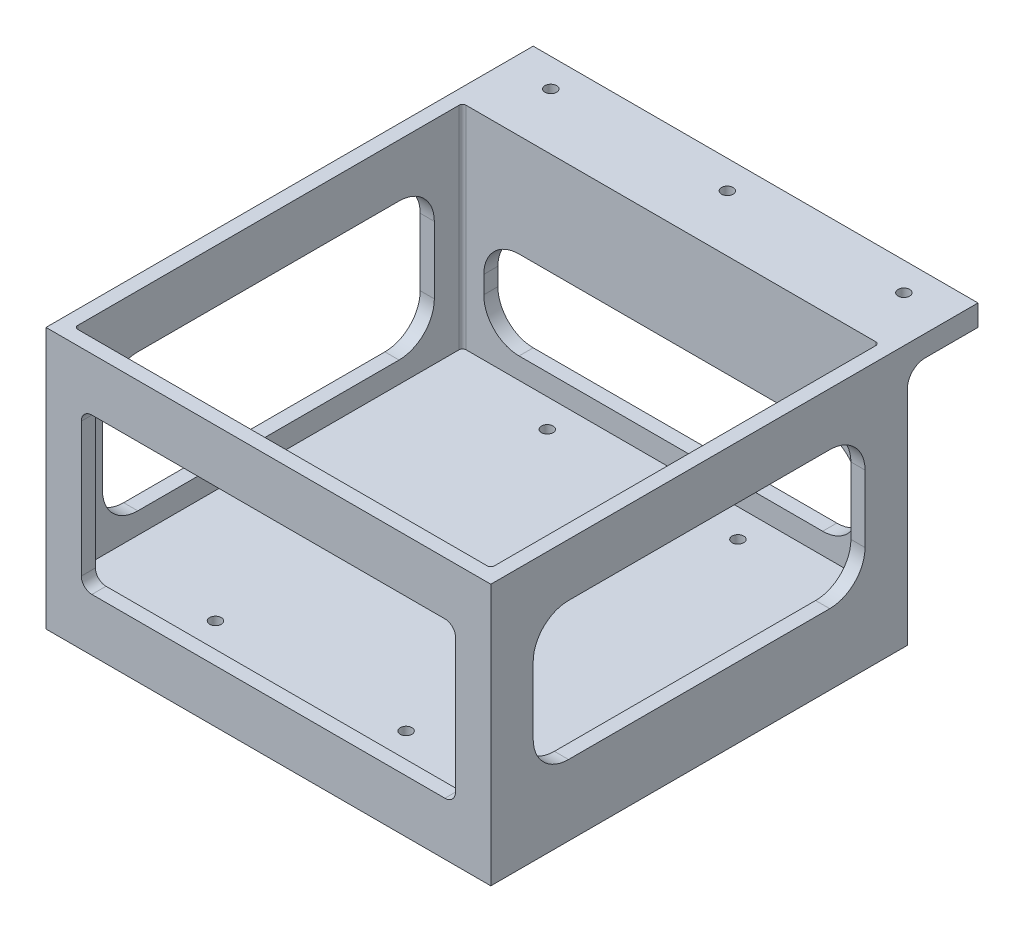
ISO-10303-21;
HEADER;
FILE_DESCRIPTION(('STEP AP214'),'2;1');
FILE_NAME('part.step','',(''),(''),'','','');
FILE_SCHEMA(('AUTOMOTIVE_DESIGN { 1 0 10303 214 1 1 1 1 }'));
ENDSEC;
DATA;
#1=APPLICATION_CONTEXT('core data for automotive mechanical design processes');
#2=APPLICATION_PROTOCOL_DEFINITION('international standard','automotive_design',2000,#1);
#3=PRODUCT_CONTEXT('',#1,'mechanical');
#4=PRODUCT('Part','Part','',(#3));
#5=PRODUCT_RELATED_PRODUCT_CATEGORY('part','',(#4));
#6=PRODUCT_DEFINITION_FORMATION('','',#4);
#7=PRODUCT_DEFINITION_CONTEXT('part definition',#1,'design');
#8=PRODUCT_DEFINITION('design','',#6,#7);
#9=PRODUCT_DEFINITION_SHAPE('','',#8);
#10=(LENGTH_UNIT() NAMED_UNIT(*) SI_UNIT(.MILLI.,.METRE.));
#11=(NAMED_UNIT(*) PLANE_ANGLE_UNIT() SI_UNIT($,.RADIAN.));
#12=(NAMED_UNIT(*) SI_UNIT($,.STERADIAN.) SOLID_ANGLE_UNIT());
#13=UNCERTAINTY_MEASURE_WITH_UNIT(LENGTH_MEASURE(1.E-05),#10,'distance_accuracy_value','');
#14=(GEOMETRIC_REPRESENTATION_CONTEXT(3) GLOBAL_UNCERTAINTY_ASSIGNED_CONTEXT((#13)) GLOBAL_UNIT_ASSIGNED_CONTEXT((#10,
#11,#12)) REPRESENTATION_CONTEXT('',''));
#15=CARTESIAN_POINT('',(0.,0.,0.));
#16=DIRECTION('',(0.,0.,1.));
#17=DIRECTION('',(1.,0.,0.));
#18=AXIS2_PLACEMENT_3D('',#15,#16,#17);
#19=CARTESIAN_POINT('',(149.,20.,-96.));
#20=DIRECTION('',(1.,0.,0.));
#21=DIRECTION('',(0.,0.,-1.));
#22=AXIS2_PLACEMENT_3D('',#19,#20,#21);
#23=CYLINDRICAL_SURFACE('',#22,10.);
#24=CARTESIAN_POINT('',(4.,20.,-96.));
#25=DIRECTION('',(-1.,0.,0.));
#26=DIRECTION('',(0.,0.,-1.));
#27=AXIS2_PLACEMENT_3D('',#24,#25,#26);
#28=CIRCLE('',#27,10.);
#29=CARTESIAN_POINT('',(4.,20.,-106.));
#30=VERTEX_POINT('',#29);
#31=CARTESIAN_POINT('',(4.,10.,-96.));
#32=VERTEX_POINT('',#31);
#33=EDGE_CURVE('E580',#30,#32,#28,.T.);
#34=ORIENTED_EDGE('',*,*,#33,.F.);
#35=DIRECTION('',(1.,0.,0.));
#36=VECTOR('',#35,1.);
#37=CARTESIAN_POINT('',(4.,20.,-106.));
#38=LINE('',#37,#36);
#39=CARTESIAN_POINT('',(0.,20.,-106.));
#40=VERTEX_POINT('',#39);
#41=EDGE_CURVE('E406',#40,#30,#38,.T.);
#42=ORIENTED_EDGE('',*,*,#41,.F.);
#43=CARTESIAN_POINT('',(0.,20.,-96.));
#44=DIRECTION('',(1.,0.,0.));
#45=DIRECTION('',(0.,0.,-1.));
#46=AXIS2_PLACEMENT_3D('',#43,#44,#45);
#47=CIRCLE('',#46,10.);
#48=CARTESIAN_POINT('',(0.,10.,-96.));
#49=VERTEX_POINT('',#48);
#50=EDGE_CURVE('E499',#49,#40,#47,.T.);
#51=ORIENTED_EDGE('',*,*,#50,.F.);
#52=DIRECTION('',(-1.,0.,0.));
#53=VECTOR('',#52,1.);
#54=CARTESIAN_POINT('',(0.,10.,-96.));
#55=LINE('',#54,#53);
#56=EDGE_CURVE('E392',#32,#49,#55,.T.);
#57=ORIENTED_EDGE('',*,*,#56,.F.);
#58=EDGE_LOOP('',(#34,#42,#51,#57));
#59=FACE_BOUND('',#58,.T.);
#60=ADVANCED_FACE('F17',(#59),#23,.F.);
#61=CARTESIAN_POINT('',(149.,39.,-96.));
#62=DIRECTION('',(1.,0.,0.));
#63=DIRECTION('',(0.,0.,-1.));
#64=AXIS2_PLACEMENT_3D('',#61,#62,#63);
#65=CYLINDRICAL_SURFACE('',#64,10.);
#66=CARTESIAN_POINT('',(4.,39.,-96.));
#67=DIRECTION('',(-1.,0.,0.));
#68=DIRECTION('',(0.,0.,-1.));
#69=AXIS2_PLACEMENT_3D('',#66,#67,#68);
#70=CIRCLE('',#69,10.);
#71=CARTESIAN_POINT('',(4.,49.,-96.));
#72=VERTEX_POINT('',#71);
#73=CARTESIAN_POINT('',(4.,39.,-106.));
#74=VERTEX_POINT('',#73);
#75=EDGE_CURVE('E553',#72,#74,#70,.T.);
#76=ORIENTED_EDGE('',*,*,#75,.F.);
#77=DIRECTION('',(1.,0.,0.));
#78=VECTOR('',#77,1.);
#79=CARTESIAN_POINT('',(4.,49.,-96.));
#80=LINE('',#79,#78);
#81=CARTESIAN_POINT('',(0.,49.,-96.));
#82=VERTEX_POINT('',#81);
#83=EDGE_CURVE('E358',#82,#72,#80,.T.);
#84=ORIENTED_EDGE('',*,*,#83,.F.);
#85=CARTESIAN_POINT('',(0.,39.,-96.));
#86=DIRECTION('',(1.,0.,0.));
#87=DIRECTION('',(0.,0.,-1.));
#88=AXIS2_PLACEMENT_3D('',#85,#86,#87);
#89=CIRCLE('',#88,10.);
#90=CARTESIAN_POINT('',(0.,39.,-106.));
#91=VERTEX_POINT('',#90);
#92=EDGE_CURVE('E814',#91,#82,#89,.T.);
#93=ORIENTED_EDGE('',*,*,#92,.F.);
#94=DIRECTION('',(-1.,0.,0.));
#95=VECTOR('',#94,1.);
#96=CARTESIAN_POINT('',(0.,39.,-106.));
#97=LINE('',#96,#95);
#98=EDGE_CURVE('E402',#74,#91,#97,.T.);
#99=ORIENTED_EDGE('',*,*,#98,.F.);
#100=EDGE_LOOP('',(#76,#84,#93,#99));
#101=FACE_BOUND('',#100,.T.);
#102=ADVANCED_FACE('F904',(#101),#65,.F.);
#103=CARTESIAN_POINT('',(126.,39.,-22.));
#104=DIRECTION('',(1.,0.,0.));
#105=DIRECTION('',(0.,0.,-1.));
#106=AXIS2_PLACEMENT_3D('',#103,#104,#105);
#107=CYLINDRICAL_SURFACE('',#106,10.);
#108=CARTESIAN_POINT('',(4.,39.,-22.));
#109=DIRECTION('',(-1.,0.,0.));
#110=DIRECTION('',(0.,0.,-1.));
#111=AXIS2_PLACEMENT_3D('',#108,#109,#110);
#112=CIRCLE('',#111,10.);
#113=CARTESIAN_POINT('',(4.,39.,-12.));
#114=VERTEX_POINT('',#113);
#115=CARTESIAN_POINT('',(4.,49.,-22.));
#116=VERTEX_POINT('',#115);
#117=EDGE_CURVE('E736',#114,#116,#112,.T.);
#118=ORIENTED_EDGE('',*,*,#117,.F.);
#119=DIRECTION('',(1.,0.,0.));
#120=VECTOR('',#119,1.);
#121=CARTESIAN_POINT('',(4.,39.,-12.));
#122=LINE('',#121,#120);
#123=CARTESIAN_POINT('',(0.,39.,-12.));
#124=VERTEX_POINT('',#123);
#125=EDGE_CURVE('E399',#124,#114,#122,.T.);
#126=ORIENTED_EDGE('',*,*,#125,.F.);
#127=CARTESIAN_POINT('',(0.,39.,-22.));
#128=DIRECTION('',(1.,0.,0.));
#129=DIRECTION('',(0.,0.,-1.));
#130=AXIS2_PLACEMENT_3D('',#127,#128,#129);
#131=CIRCLE('',#130,10.);
#132=CARTESIAN_POINT('',(0.,49.,-22.));
#133=VERTEX_POINT('',#132);
#134=EDGE_CURVE('E653',#133,#124,#131,.T.);
#135=ORIENTED_EDGE('',*,*,#134,.F.);
#136=DIRECTION('',(-1.,0.,0.));
#137=VECTOR('',#136,1.);
#138=CARTESIAN_POINT('',(0.,49.,-22.));
#139=LINE('',#138,#137);
#140=EDGE_CURVE('E355',#116,#133,#139,.T.);
#141=ORIENTED_EDGE('',*,*,#140,.F.);
#142=EDGE_LOOP('',(#118,#126,#135,#141));
#143=FACE_BOUND('',#142,.T.);
#144=ADVANCED_FACE('F909',(#143),#107,.F.);
#145=CARTESIAN_POINT('',(149.,20.,-22.));
#146=DIRECTION('',(1.,0.,0.));
#147=DIRECTION('',(0.,0.,-1.));
#148=AXIS2_PLACEMENT_3D('',#145,#146,#147);
#149=CYLINDRICAL_SURFACE('',#148,10.);
#150=CARTESIAN_POINT('',(4.,20.,-22.));
#151=DIRECTION('',(-1.,0.,0.));
#152=DIRECTION('',(0.,0.,-1.));
#153=AXIS2_PLACEMENT_3D('',#150,#151,#152);
#154=CIRCLE('',#153,10.);
#155=CARTESIAN_POINT('',(4.,10.,-22.));
#156=VERTEX_POINT('',#155);
#157=CARTESIAN_POINT('',(4.,20.,-12.));
#158=VERTEX_POINT('',#157);
#159=EDGE_CURVE('E592',#156,#158,#154,.T.);
#160=ORIENTED_EDGE('',*,*,#159,.F.);
#161=DIRECTION('',(1.,0.,0.));
#162=VECTOR('',#161,1.);
#163=CARTESIAN_POINT('',(4.,10.,-22.));
#164=LINE('',#163,#162);
#165=CARTESIAN_POINT('',(0.,10.,-22.));
#166=VERTEX_POINT('',#165);
#167=EDGE_CURVE('E277',#166,#156,#164,.T.);
#168=ORIENTED_EDGE('',*,*,#167,.F.);
#169=CARTESIAN_POINT('',(0.,20.,-22.));
#170=DIRECTION('',(1.,0.,0.));
#171=DIRECTION('',(0.,0.,-1.));
#172=AXIS2_PLACEMENT_3D('',#169,#170,#171);
#173=CIRCLE('',#172,10.);
#174=CARTESIAN_POINT('',(0.,20.,-12.));
#175=VERTEX_POINT('',#174);
#176=EDGE_CURVE('E493',#175,#166,#173,.T.);
#177=ORIENTED_EDGE('',*,*,#176,.F.);
#178=DIRECTION('',(-1.,0.,0.));
#179=VECTOR('',#178,1.);
#180=CARTESIAN_POINT('',(0.,20.,-12.));
#181=LINE('',#180,#179);
#182=EDGE_CURVE('E395',#158,#175,#181,.T.);
#183=ORIENTED_EDGE('',*,*,#182,.F.);
#184=EDGE_LOOP('',(#160,#168,#177,#183));
#185=FACE_BOUND('',#184,.T.);
#186=ADVANCED_FACE('F1050',(#185),#149,.F.);
#187=CARTESIAN_POINT('',(106.,25.,-108.));
#188=DIRECTION('',(0.,0.,1.));
#189=DIRECTION('',(1.,0.,0.));
#190=AXIS2_PLACEMENT_3D('',#187,#188,#189);
#191=CYLINDRICAL_SURFACE('',#190,10.);
#192=CARTESIAN_POINT('',(106.,25.,-114.));
#193=DIRECTION('',(0.,0.,-1.));
#194=DIRECTION('',(1.,0.,0.));
#195=AXIS2_PLACEMENT_3D('',#192,#193,#194);
#196=CIRCLE('',#195,10.);
#197=CARTESIAN_POINT('',(106.,35.,-114.));
#198=VERTEX_POINT('',#197);
#199=CARTESIAN_POINT('',(116.,25.,-114.));
#200=VERTEX_POINT('',#199);
#201=EDGE_CURVE('E316',#198,#200,#196,.T.);
#202=ORIENTED_EDGE('',*,*,#201,.F.);
#203=DIRECTION('',(0.,0.,1.));
#204=VECTOR('',#203,1.);
#205=CARTESIAN_POINT('',(106.,35.,-114.));
#206=LINE('',#205,#204);
#207=CARTESIAN_POINT('',(106.,35.,-118.));
#208=VERTEX_POINT('',#207);
#209=EDGE_CURVE('E39',#208,#198,#206,.T.);
#210=ORIENTED_EDGE('',*,*,#209,.F.);
#211=CARTESIAN_POINT('',(106.,25.,-118.));
#212=DIRECTION('',(0.,0.,1.));
#213=DIRECTION('',(1.,0.,0.));
#214=AXIS2_PLACEMENT_3D('',#211,#212,#213);
#215=CIRCLE('',#214,10.);
#216=CARTESIAN_POINT('',(116.,25.,-118.));
#217=VERTEX_POINT('',#216);
#218=EDGE_CURVE('E710',#217,#208,#215,.T.);
#219=ORIENTED_EDGE('',*,*,#218,.F.);
#220=DIRECTION('',(0.,0.,-1.));
#221=VECTOR('',#220,1.);
#222=CARTESIAN_POINT('',(116.,25.,-118.));
#223=LINE('',#222,#221);
#224=EDGE_CURVE('E371',#200,#217,#223,.T.);
#225=ORIENTED_EDGE('',*,*,#224,.F.);
#226=EDGE_LOOP('',(#202,#210,#219,#225));
#227=FACE_BOUND('',#226,.T.);
#228=ADVANCED_FACE('F2061',(#227),#191,.F.);
#229=CARTESIAN_POINT('',(106.,20.,-108.));
#230=DIRECTION('',(0.,0.,1.));
#231=DIRECTION('',(1.,0.,0.));
#232=AXIS2_PLACEMENT_3D('',#229,#230,#231);
#233=CYLINDRICAL_SURFACE('',#232,10.);
#234=CARTESIAN_POINT('',(106.,20.,-114.));
#235=DIRECTION('',(0.,0.,-1.));
#236=DIRECTION('',(1.,0.,0.));
#237=AXIS2_PLACEMENT_3D('',#234,#235,#236);
#238=CIRCLE('',#237,10.);
#239=CARTESIAN_POINT('',(116.,20.,-114.));
#240=VERTEX_POINT('',#239);
#241=CARTESIAN_POINT('',(106.,10.,-114.));
#242=VERTEX_POINT('',#241);
#243=EDGE_CURVE('E268',#240,#242,#238,.T.);
#244=ORIENTED_EDGE('',*,*,#243,.F.);
#245=DIRECTION('',(0.,0.,1.));
#246=VECTOR('',#245,1.);
#247=CARTESIAN_POINT('',(116.,20.,-114.));
#248=LINE('',#247,#246);
#249=CARTESIAN_POINT('',(116.,20.,-118.));
#250=VERTEX_POINT('',#249);
#251=EDGE_CURVE('E368',#250,#240,#248,.T.);
#252=ORIENTED_EDGE('',*,*,#251,.F.);
#253=CARTESIAN_POINT('',(106.,20.,-118.));
#254=DIRECTION('',(0.,0.,1.));
#255=DIRECTION('',(1.,0.,0.));
#256=AXIS2_PLACEMENT_3D('',#253,#254,#255);
#257=CIRCLE('',#256,10.);
#258=CARTESIAN_POINT('',(106.,10.,-118.));
#259=VERTEX_POINT('',#258);
#260=EDGE_CURVE('E272',#259,#250,#257,.T.);
#261=ORIENTED_EDGE('',*,*,#260,.F.);
#262=DIRECTION('',(0.,0.,-1.));
#263=VECTOR('',#262,1.);
#264=CARTESIAN_POINT('',(106.,10.,-118.));
#265=LINE('',#264,#263);
#266=EDGE_CURVE('E263',#242,#259,#265,.T.);
#267=ORIENTED_EDGE('',*,*,#266,.F.);
#268=EDGE_LOOP('',(#244,#252,#261,#267));
#269=FACE_BOUND('',#268,.T.);
#270=ADVANCED_FACE('F265',(#269),#233,.F.);
#271=CARTESIAN_POINT('',(20.,20.,-108.));
#272=DIRECTION('',(0.,0.,1.));
#273=DIRECTION('',(1.,0.,0.));
#274=AXIS2_PLACEMENT_3D('',#271,#272,#273);
#275=CYLINDRICAL_SURFACE('',#274,10.);
#276=CARTESIAN_POINT('',(20.,20.,-114.));
#277=DIRECTION('',(0.,0.,-1.));
#278=DIRECTION('',(1.,0.,0.));
#279=AXIS2_PLACEMENT_3D('',#276,#277,#278);
#280=CIRCLE('',#279,10.);
#281=CARTESIAN_POINT('',(20.,10.,-114.));
#282=VERTEX_POINT('',#281);
#283=CARTESIAN_POINT('',(10.,20.,-114.));
#284=VERTEX_POINT('',#283);
#285=EDGE_CURVE('E288',#282,#284,#280,.T.);
#286=ORIENTED_EDGE('',*,*,#285,.F.);
#287=DIRECTION('',(0.,0.,1.));
#288=VECTOR('',#287,1.);
#289=CARTESIAN_POINT('',(20.,10.,-114.));
#290=LINE('',#289,#288);
#291=CARTESIAN_POINT('',(20.,10.,-118.));
#292=VERTEX_POINT('',#291);
#293=EDGE_CURVE('E278',#292,#282,#290,.T.);
#294=ORIENTED_EDGE('',*,*,#293,.F.);
#295=CARTESIAN_POINT('',(20.,20.,-118.));
#296=DIRECTION('',(0.,0.,1.));
#297=DIRECTION('',(1.,0.,0.));
#298=AXIS2_PLACEMENT_3D('',#295,#296,#297);
#299=CIRCLE('',#298,10.);
#300=CARTESIAN_POINT('',(10.,20.,-118.));
#301=VERTEX_POINT('',#300);
#302=EDGE_CURVE('E728',#301,#292,#299,.T.);
#303=ORIENTED_EDGE('',*,*,#302,.F.);
#304=DIRECTION('',(0.,0.,-1.));
#305=VECTOR('',#304,1.);
#306=CARTESIAN_POINT('',(10.,20.,-118.));
#307=LINE('',#306,#305);
#308=EDGE_CURVE('E384',#284,#301,#307,.T.);
#309=ORIENTED_EDGE('',*,*,#308,.F.);
#310=EDGE_LOOP('',(#286,#294,#303,#309));
#311=FACE_BOUND('',#310,.T.);
#312=ADVANCED_FACE('F1986',(#311),#275,.F.);
#313=CARTESIAN_POINT('',(20.,25.,-108.));
#314=DIRECTION('',(0.,0.,1.));
#315=DIRECTION('',(1.,0.,0.));
#316=AXIS2_PLACEMENT_3D('',#313,#314,#315);
#317=CYLINDRICAL_SURFACE('',#316,10.);
#318=CARTESIAN_POINT('',(20.,25.,-114.));
#319=DIRECTION('',(0.,0.,-1.));
#320=DIRECTION('',(1.,0.,0.));
#321=AXIS2_PLACEMENT_3D('',#318,#319,#320);
#322=CIRCLE('',#321,10.);
#323=CARTESIAN_POINT('',(10.,25.,-114.));
#324=VERTEX_POINT('',#323);
#325=CARTESIAN_POINT('',(20.,35.,-114.));
#326=VERTEX_POINT('',#325);
#327=EDGE_CURVE('E311',#324,#326,#322,.T.);
#328=ORIENTED_EDGE('',*,*,#327,.F.);
#329=DIRECTION('',(0.,0.,1.));
#330=VECTOR('',#329,1.);
#331=CARTESIAN_POINT('',(10.,25.,-114.));
#332=LINE('',#331,#330);
#333=CARTESIAN_POINT('',(10.,25.,-118.));
#334=VERTEX_POINT('',#333);
#335=EDGE_CURVE('E381',#334,#324,#332,.T.);
#336=ORIENTED_EDGE('',*,*,#335,.F.);
#337=CARTESIAN_POINT('',(20.,25.,-118.));
#338=DIRECTION('',(0.,0.,1.));
#339=DIRECTION('',(1.,0.,0.));
#340=AXIS2_PLACEMENT_3D('',#337,#338,#339);
#341=CIRCLE('',#340,10.);
#342=CARTESIAN_POINT('',(20.,35.,-118.));
#343=VERTEX_POINT('',#342);
#344=EDGE_CURVE('E720',#343,#334,#341,.T.);
#345=ORIENTED_EDGE('',*,*,#344,.F.);
#346=DIRECTION('',(0.,0.,-1.));
#347=VECTOR('',#346,1.);
#348=CARTESIAN_POINT('',(20.,35.,-118.));
#349=LINE('',#348,#347);
#350=EDGE_CURVE('E375',#326,#343,#349,.T.);
#351=ORIENTED_EDGE('',*,*,#350,.F.);
#352=EDGE_LOOP('',(#328,#336,#345,#351));
#353=FACE_BOUND('',#352,.T.);
#354=ADVANCED_FACE('F1990',(#353),#317,.F.);
#355=CARTESIAN_POINT('',(149.,20.,-22.));
#356=DIRECTION('',(1.,0.,0.));
#357=DIRECTION('',(0.,0.,-1.));
#358=AXIS2_PLACEMENT_3D('',#355,#356,#357);
#359=CYLINDRICAL_SURFACE('',#358,10.);
#360=CARTESIAN_POINT('',(126.,20.,-22.));
#361=DIRECTION('',(-1.,0.,0.));
#362=DIRECTION('',(0.,0.,1.));
#363=AXIS2_PLACEMENT_3D('',#360,#361,#362);
#364=CIRCLE('',#363,10.);
#365=CARTESIAN_POINT('',(126.,10.,-22.));
#366=VERTEX_POINT('',#365);
#367=CARTESIAN_POINT('',(126.,20.,-12.));
#368=VERTEX_POINT('',#367);
#369=EDGE_CURVE('E774',#366,#368,#364,.T.);
#370=ORIENTED_EDGE('',*,*,#369,.F.);
#371=DIRECTION('',(1.,0.,0.));
#372=VECTOR('',#371,1.);
#373=CARTESIAN_POINT('',(126.,10.,-22.));
#374=LINE('',#373,#372);
#375=CARTESIAN_POINT('',(122.,10.,-22.));
#376=VERTEX_POINT('',#375);
#377=EDGE_CURVE('E11',#376,#366,#374,.T.);
#378=ORIENTED_EDGE('',*,*,#377,.F.);
#379=CARTESIAN_POINT('',(122.,20.,-22.));
#380=DIRECTION('',(1.,0.,0.));
#381=DIRECTION('',(0.,0.,1.));
#382=AXIS2_PLACEMENT_3D('',#379,#380,#381);
#383=CIRCLE('',#382,10.);
#384=CARTESIAN_POINT('',(122.,20.,-12.));
#385=VERTEX_POINT('',#384);
#386=EDGE_CURVE('E453',#385,#376,#383,.T.);
#387=ORIENTED_EDGE('',*,*,#386,.F.);
#388=DIRECTION('',(-1.,0.,0.));
#389=VECTOR('',#388,1.);
#390=CARTESIAN_POINT('',(122.,20.,-12.));
#391=LINE('',#390,#389);
#392=EDGE_CURVE('E420',#368,#385,#391,.T.);
#393=ORIENTED_EDGE('',*,*,#392,.F.);
#394=EDGE_LOOP('',(#370,#378,#387,#393));
#395=FACE_BOUND('',#394,.T.);
#396=ADVANCED_FACE('F2037',(#395),#359,.F.);
#397=CARTESIAN_POINT('',(126.,39.,-22.));
#398=DIRECTION('',(1.,0.,0.));
#399=DIRECTION('',(0.,0.,-1.));
#400=AXIS2_PLACEMENT_3D('',#397,#398,#399);
#401=CYLINDRICAL_SURFACE('',#400,10.);
#402=CARTESIAN_POINT('',(126.,39.,-22.));
#403=DIRECTION('',(-1.,0.,0.));
#404=DIRECTION('',(0.,0.,1.));
#405=AXIS2_PLACEMENT_3D('',#402,#403,#404);
#406=CIRCLE('',#405,10.);
#407=CARTESIAN_POINT('',(126.,39.,-12.));
#408=VERTEX_POINT('',#407);
#409=CARTESIAN_POINT('',(126.,49.,-22.));
#410=VERTEX_POINT('',#409);
#411=EDGE_CURVE('E674',#408,#410,#406,.T.);
#412=ORIENTED_EDGE('',*,*,#411,.F.);
#413=DIRECTION('',(1.,0.,0.));
#414=VECTOR('',#413,1.);
#415=CARTESIAN_POINT('',(126.,39.,-12.));
#416=LINE('',#415,#414);
#417=CARTESIAN_POINT('',(122.,39.,-12.));
#418=VERTEX_POINT('',#417);
#419=EDGE_CURVE('E416',#418,#408,#416,.T.);
#420=ORIENTED_EDGE('',*,*,#419,.F.);
#421=CARTESIAN_POINT('',(122.,39.,-22.));
#422=DIRECTION('',(1.,0.,0.));
#423=DIRECTION('',(0.,0.,1.));
#424=AXIS2_PLACEMENT_3D('',#421,#422,#423);
#425=CIRCLE('',#424,10.);
#426=CARTESIAN_POINT('',(122.,49.,-22.));
#427=VERTEX_POINT('',#426);
#428=EDGE_CURVE('E535',#427,#418,#425,.T.);
#429=ORIENTED_EDGE('',*,*,#428,.F.);
#430=DIRECTION('',(-1.,0.,0.));
#431=VECTOR('',#430,1.);
#432=CARTESIAN_POINT('',(122.,49.,-22.));
#433=LINE('',#432,#431);
#434=EDGE_CURVE('E351',#410,#427,#433,.T.);
#435=ORIENTED_EDGE('',*,*,#434,.F.);
#436=EDGE_LOOP('',(#412,#420,#429,#435));
#437=FACE_BOUND('',#436,.T.);
#438=ADVANCED_FACE('F2028',(#437),#401,.F.);
#439=CARTESIAN_POINT('',(149.,39.,-96.));
#440=DIRECTION('',(1.,0.,0.));
#441=DIRECTION('',(0.,0.,-1.));
#442=AXIS2_PLACEMENT_3D('',#439,#440,#441);
#443=CYLINDRICAL_SURFACE('',#442,10.);
#444=CARTESIAN_POINT('',(126.,39.,-96.));
#445=DIRECTION('',(-1.,0.,0.));
#446=DIRECTION('',(0.,0.,1.));
#447=AXIS2_PLACEMENT_3D('',#444,#445,#446);
#448=CIRCLE('',#447,10.);
#449=CARTESIAN_POINT('',(126.,49.,-96.));
#450=VERTEX_POINT('',#449);
#451=CARTESIAN_POINT('',(126.,39.,-106.));
#452=VERTEX_POINT('',#451);
#453=EDGE_CURVE('E764',#450,#452,#448,.T.);
#454=ORIENTED_EDGE('',*,*,#453,.F.);
#455=DIRECTION('',(1.,0.,0.));
#456=VECTOR('',#455,1.);
#457=CARTESIAN_POINT('',(126.,49.,-96.));
#458=LINE('',#457,#456);
#459=CARTESIAN_POINT('',(122.,49.,-96.));
#460=VERTEX_POINT('',#459);
#461=EDGE_CURVE('E347',#460,#450,#458,.T.);
#462=ORIENTED_EDGE('',*,*,#461,.F.);
#463=CARTESIAN_POINT('',(122.,39.,-96.));
#464=DIRECTION('',(1.,0.,0.));
#465=DIRECTION('',(0.,0.,1.));
#466=AXIS2_PLACEMENT_3D('',#463,#464,#465);
#467=CIRCLE('',#466,10.);
#468=CARTESIAN_POINT('',(122.,39.,-106.));
#469=VERTEX_POINT('',#468);
#470=EDGE_CURVE('E536',#469,#460,#467,.T.);
#471=ORIENTED_EDGE('',*,*,#470,.F.);
#472=DIRECTION('',(-1.,0.,0.));
#473=VECTOR('',#472,1.);
#474=CARTESIAN_POINT('',(122.,39.,-106.));
#475=LINE('',#474,#473);
#476=EDGE_CURVE('E413',#452,#469,#475,.T.);
#477=ORIENTED_EDGE('',*,*,#476,.F.);
#478=EDGE_LOOP('',(#454,#462,#471,#477));
#479=FACE_BOUND('',#478,.T.);
#480=ADVANCED_FACE('F2020',(#479),#443,.F.);
#481=CARTESIAN_POINT('',(149.,20.,-96.));
#482=DIRECTION('',(1.,0.,0.));
#483=DIRECTION('',(0.,0.,-1.));
#484=AXIS2_PLACEMENT_3D('',#481,#482,#483);
#485=CYLINDRICAL_SURFACE('',#484,10.);
#486=CARTESIAN_POINT('',(126.,20.,-96.));
#487=DIRECTION('',(-1.,0.,0.));
#488=DIRECTION('',(0.,0.,1.));
#489=AXIS2_PLACEMENT_3D('',#486,#487,#488);
#490=CIRCLE('',#489,10.);
#491=CARTESIAN_POINT('',(126.,20.,-106.));
#492=VERTEX_POINT('',#491);
#493=CARTESIAN_POINT('',(126.,10.,-96.));
#494=VERTEX_POINT('',#493);
#495=EDGE_CURVE('E769',#492,#494,#490,.T.);
#496=ORIENTED_EDGE('',*,*,#495,.F.);
#497=DIRECTION('',(1.,0.,0.));
#498=VECTOR('',#497,1.);
#499=CARTESIAN_POINT('',(126.,20.,-106.));
#500=LINE('',#499,#498);
#501=CARTESIAN_POINT('',(122.,20.,-106.));
#502=VERTEX_POINT('',#501);
#503=EDGE_CURVE('E409',#502,#492,#500,.T.);
#504=ORIENTED_EDGE('',*,*,#503,.F.);
#505=CARTESIAN_POINT('',(122.,20.,-96.));
#506=DIRECTION('',(1.,0.,0.));
#507=DIRECTION('',(0.,0.,1.));
#508=AXIS2_PLACEMENT_3D('',#505,#506,#507);
#509=CIRCLE('',#508,10.);
#510=CARTESIAN_POINT('',(122.,10.,-96.));
#511=VERTEX_POINT('',#510);
#512=EDGE_CURVE('E441',#511,#502,#509,.T.);
#513=ORIENTED_EDGE('',*,*,#512,.F.);
#514=DIRECTION('',(-1.,0.,0.));
#515=VECTOR('',#514,1.);
#516=CARTESIAN_POINT('',(122.,10.,-96.));
#517=LINE('',#516,#515);
#518=EDGE_CURVE('E26',#494,#511,#517,.T.);
#519=ORIENTED_EDGE('',*,*,#518,.F.);
#520=EDGE_LOOP('',(#496,#504,#513,#519));
#521=FACE_BOUND('',#520,.T.);
#522=ADVANCED_FACE('F442',(#521),#485,.F.);
#523=CARTESIAN_POINT('',(149.,10.,-106.));
#524=DIRECTION('',(0.,-1.,0.));
#525=DIRECTION('',(0.,0.,-1.));
#526=AXIS2_PLACEMENT_3D('',#523,#524,#525);
#527=PLANE('',#526);
#528=DIRECTION('',(0.,0.,1.));
#529=VECTOR('',#528,1.);
#530=CARTESIAN_POINT('',(126.,10.,0.));
#531=LINE('',#530,#529);
#532=EDGE_CURVE('E436',#494,#366,#531,.T.);
#533=ORIENTED_EDGE('',*,*,#532,.F.);
#534=ORIENTED_EDGE('',*,*,#518,.T.);
#535=DIRECTION('',(0.,0.,1.));
#536=VECTOR('',#535,1.);
#537=CARTESIAN_POINT('',(122.,10.,-114.));
#538=LINE('',#537,#536);
#539=EDGE_CURVE('E432',#511,#376,#538,.T.);
#540=ORIENTED_EDGE('',*,*,#539,.T.);
#541=ORIENTED_EDGE('',*,*,#377,.T.);
#542=EDGE_LOOP('',(#533,#534,#540,#541));
#543=FACE_BOUND('',#542,.T.);
#544=ADVANCED_FACE('F430',(#543),#527,.F.);
#545=CARTESIAN_POINT('',(149.,49.,-12.));
#546=DIRECTION('',(0.,0.,1.));
#547=DIRECTION('',(1.,0.,0.));
#548=AXIS2_PLACEMENT_3D('',#545,#546,#547);
#549=PLANE('',#548);
#550=DIRECTION('',(0.,1.,0.));
#551=VECTOR('',#550,1.);
#552=CARTESIAN_POINT('',(122.,64.,-12.));
#553=LINE('',#552,#551);
#554=EDGE_CURVE('E459',#385,#418,#553,.T.);
#555=ORIENTED_EDGE('',*,*,#554,.T.);
#556=ORIENTED_EDGE('',*,*,#419,.T.);
#557=DIRECTION('',(0.,1.,0.));
#558=VECTOR('',#557,1.);
#559=CARTESIAN_POINT('',(126.,4.,-12.));
#560=LINE('',#559,#558);
#561=EDGE_CURVE('E670',#368,#408,#560,.T.);
#562=ORIENTED_EDGE('',*,*,#561,.F.);
#563=ORIENTED_EDGE('',*,*,#392,.T.);
#564=EDGE_LOOP('',(#555,#556,#562,#563));
#565=FACE_BOUND('',#564,.T.);
#566=ADVANCED_FACE('F1820',(#565),#549,.F.);
#567=CARTESIAN_POINT('',(149.,49.,-106.));
#568=DIRECTION('',(0.,0.,-1.));
#569=DIRECTION('',(0.,-1.,0.));
#570=AXIS2_PLACEMENT_3D('',#567,#568,#569);
#571=PLANE('',#570);
#572=DIRECTION('',(0.,-1.,0.));
#573=VECTOR('',#572,1.);
#574=CARTESIAN_POINT('',(122.,64.,-106.));
#575=LINE('',#574,#573);
#576=EDGE_CURVE('E623',#469,#502,#575,.T.);
#577=ORIENTED_EDGE('',*,*,#576,.T.);
#578=ORIENTED_EDGE('',*,*,#503,.T.);
#579=DIRECTION('',(0.,-1.,0.));
#580=VECTOR('',#579,1.);
#581=CARTESIAN_POINT('',(126.,4.,-106.));
#582=LINE('',#581,#580);
#583=EDGE_CURVE('E768',#452,#492,#582,.T.);
#584=ORIENTED_EDGE('',*,*,#583,.F.);
#585=ORIENTED_EDGE('',*,*,#476,.T.);
#586=EDGE_LOOP('',(#577,#578,#584,#585));
#587=FACE_BOUND('',#586,.T.);
#588=ADVANCED_FACE('F1816',(#587),#571,.F.);
#589=CARTESIAN_POINT('',(149.,49.,-106.));
#590=DIRECTION('',(0.,0.,-1.));
#591=DIRECTION('',(0.,-1.,0.));
#592=AXIS2_PLACEMENT_3D('',#589,#590,#591);
#593=PLANE('',#592);
#594=DIRECTION('',(0.,1.,0.));
#595=VECTOR('',#594,1.);
#596=CARTESIAN_POINT('',(4.,64.,-106.));
#597=LINE('',#596,#595);
#598=EDGE_CURVE('E557',#30,#74,#597,.T.);
#599=ORIENTED_EDGE('',*,*,#598,.T.);
#600=ORIENTED_EDGE('',*,*,#98,.T.);
#601=DIRECTION('',(0.,-1.,0.));
#602=VECTOR('',#601,1.);
#603=CARTESIAN_POINT('',(0.,49.,-106.));
#604=LINE('',#603,#602);
#605=EDGE_CURVE('E808',#91,#40,#604,.T.);
#606=ORIENTED_EDGE('',*,*,#605,.T.);
#607=ORIENTED_EDGE('',*,*,#41,.T.);
#608=EDGE_LOOP('',(#599,#600,#606,#607));
#609=FACE_BOUND('',#608,.T.);
#610=ADVANCED_FACE('F920',(#609),#593,.F.);
#611=CARTESIAN_POINT('',(149.,49.,-12.));
#612=DIRECTION('',(0.,0.,1.));
#613=DIRECTION('',(1.,0.,0.));
#614=AXIS2_PLACEMENT_3D('',#611,#612,#613);
#615=PLANE('',#614);
#616=DIRECTION('',(0.,-1.,0.));
#617=VECTOR('',#616,1.);
#618=CARTESIAN_POINT('',(4.,64.,-12.));
#619=LINE('',#618,#617);
#620=EDGE_CURVE('E732',#114,#158,#619,.T.);
#621=ORIENTED_EDGE('',*,*,#620,.T.);
#622=ORIENTED_EDGE('',*,*,#182,.T.);
#623=DIRECTION('',(0.,1.,0.));
#624=VECTOR('',#623,1.);
#625=CARTESIAN_POINT('',(0.,49.,-12.));
#626=LINE('',#625,#624);
#627=EDGE_CURVE('E649',#175,#124,#626,.T.);
#628=ORIENTED_EDGE('',*,*,#627,.T.);
#629=ORIENTED_EDGE('',*,*,#125,.T.);
#630=EDGE_LOOP('',(#621,#622,#628,#629));
#631=FACE_BOUND('',#630,.T.);
#632=ADVANCED_FACE('F1043',(#631),#615,.F.);
#633=CARTESIAN_POINT('',(149.,10.,-106.));
#634=DIRECTION('',(0.,-1.,0.));
#635=DIRECTION('',(0.,0.,-1.));
#636=AXIS2_PLACEMENT_3D('',#633,#634,#635);
#637=PLANE('',#636);
#638=DIRECTION('',(0.,0.,1.));
#639=VECTOR('',#638,1.);
#640=CARTESIAN_POINT('',(0.,10.,-106.));
#641=LINE('',#640,#639);
#642=EDGE_CURVE('E495',#49,#166,#641,.T.);
#643=ORIENTED_EDGE('',*,*,#642,.T.);
#644=ORIENTED_EDGE('',*,*,#167,.T.);
#645=DIRECTION('',(0.,0.,-1.));
#646=VECTOR('',#645,1.);
#647=CARTESIAN_POINT('',(4.,10.,-114.));
#648=LINE('',#647,#646);
#649=EDGE_CURVE('E588',#156,#32,#648,.T.);
#650=ORIENTED_EDGE('',*,*,#649,.T.);
#651=ORIENTED_EDGE('',*,*,#56,.T.);
#652=EDGE_LOOP('',(#643,#644,#650,#651));
#653=FACE_BOUND('',#652,.T.);
#654=ADVANCED_FACE('F1973',(#653),#637,.F.);
#655=CARTESIAN_POINT('',(5.,64.,-113.));
#656=DIRECTION('',(0.,1.,0.));
#657=DIRECTION('',(0.,0.,1.));
#658=AXIS2_PLACEMENT_3D('',#655,#656,#657);
#659=CYLINDRICAL_SURFACE('',#658,1.);
#660=CARTESIAN_POINT('',(5.,64.,-113.));
#661=DIRECTION('',(0.,-1.,0.));
#662=DIRECTION('',(0.,0.,1.));
#663=AXIS2_PLACEMENT_3D('',#660,#661,#662);
#664=CIRCLE('',#663,1.);
#665=CARTESIAN_POINT('',(4.,64.,-113.));
#666=VERTEX_POINT('',#665);
#667=CARTESIAN_POINT('',(5.,64.,-114.));
#668=VERTEX_POINT('',#667);
#669=EDGE_CURVE('E514',#666,#668,#664,.T.);
#670=ORIENTED_EDGE('',*,*,#669,.F.);
#671=DIRECTION('',(0.,1.,0.));
#672=VECTOR('',#671,1.);
#673=CARTESIAN_POINT('',(4.,64.,-113.));
#674=LINE('',#673,#672);
#675=CARTESIAN_POINT('',(4.,4.,-113.));
#676=VERTEX_POINT('',#675);
#677=EDGE_CURVE('E562',#676,#666,#674,.T.);
#678=ORIENTED_EDGE('',*,*,#677,.F.);
#679=CARTESIAN_POINT('',(5.,4.,-113.));
#680=DIRECTION('',(0.,1.,0.));
#681=DIRECTION('',(0.,0.,-1.));
#682=AXIS2_PLACEMENT_3D('',#679,#680,#681);
#683=CIRCLE('',#682,1.);
#684=CARTESIAN_POINT('',(5.,4.,-114.));
#685=VERTEX_POINT('',#684);
#686=EDGE_CURVE('E320',#685,#676,#683,.T.);
#687=ORIENTED_EDGE('',*,*,#686,.F.);
#688=DIRECTION('',(0.,-1.,0.));
#689=VECTOR('',#688,1.);
#690=CARTESIAN_POINT('',(5.,4.,-114.));
#691=LINE('',#690,#689);
#692=EDGE_CURVE('E301',#668,#685,#691,.T.);
#693=ORIENTED_EDGE('',*,*,#692,.F.);
#694=EDGE_LOOP('',(#670,#678,#687,#693));
#695=FACE_BOUND('',#694,.T.);
#696=ADVANCED_FACE('F1773',(#695),#659,.F.);
#697=CARTESIAN_POINT('',(121.,64.,-113.));
#698=DIRECTION('',(0.,1.,0.));
#699=DIRECTION('',(0.,0.,1.));
#700=AXIS2_PLACEMENT_3D('',#697,#698,#699);
#701=CYLINDRICAL_SURFACE('',#700,1.);
#702=CARTESIAN_POINT('',(121.,64.,-113.));
#703=DIRECTION('',(0.,-1.,0.));
#704=DIRECTION('',(0.,0.,1.));
#705=AXIS2_PLACEMENT_3D('',#702,#703,#704);
#706=CIRCLE('',#705,1.);
#707=CARTESIAN_POINT('',(121.,64.,-114.));
#708=VERTEX_POINT('',#707);
#709=CARTESIAN_POINT('',(122.,64.,-113.));
#710=VERTEX_POINT('',#709);
#711=EDGE_CURVE('E569',#708,#710,#706,.T.);
#712=ORIENTED_EDGE('',*,*,#711,.F.);
#713=DIRECTION('',(0.,1.,0.));
#714=VECTOR('',#713,1.);
#715=CARTESIAN_POINT('',(121.,64.,-114.));
#716=LINE('',#715,#714);
#717=CARTESIAN_POINT('',(121.,4.,-114.));
#718=VERTEX_POINT('',#717);
#719=EDGE_CURVE('E463',#718,#708,#716,.T.);
#720=ORIENTED_EDGE('',*,*,#719,.F.);
#721=CARTESIAN_POINT('',(121.,4.,-113.));
#722=DIRECTION('',(0.,1.,0.));
#723=DIRECTION('',(0.,0.,-1.));
#724=AXIS2_PLACEMENT_3D('',#721,#722,#723);
#725=CIRCLE('',#724,1.);
#726=CARTESIAN_POINT('',(122.,4.,-113.));
#727=VERTEX_POINT('',#726);
#728=EDGE_CURVE('E324',#727,#718,#725,.T.);
#729=ORIENTED_EDGE('',*,*,#728,.F.);
#730=DIRECTION('',(0.,-1.,0.));
#731=VECTOR('',#730,1.);
#732=CARTESIAN_POINT('',(122.,4.,-113.));
#733=LINE('',#732,#731);
#734=EDGE_CURVE('E621',#710,#727,#733,.T.);
#735=ORIENTED_EDGE('',*,*,#734,.F.);
#736=EDGE_LOOP('',(#712,#720,#729,#735));
#737=FACE_BOUND('',#736,.T.);
#738=ADVANCED_FACE('F1750',(#737),#701,.F.);
#739=CARTESIAN_POINT('',(5.,64.,-5.));
#740=DIRECTION('',(0.,1.,0.));
#741=DIRECTION('',(0.,0.,1.));
#742=AXIS2_PLACEMENT_3D('',#739,#740,#741);
#743=CYLINDRICAL_SURFACE('',#742,1.);
#744=CARTESIAN_POINT('',(5.,64.,-5.));
#745=DIRECTION('',(0.,-1.,0.));
#746=DIRECTION('',(0.,0.,1.));
#747=AXIS2_PLACEMENT_3D('',#744,#745,#746);
#748=CIRCLE('',#747,1.);
#749=CARTESIAN_POINT('',(5.,64.,-4.));
#750=VERTEX_POINT('',#749);
#751=CARTESIAN_POINT('',(4.,64.,-5.));
#752=VERTEX_POINT('',#751);
#753=EDGE_CURVE('E552',#750,#752,#748,.T.);
#754=ORIENTED_EDGE('',*,*,#753,.F.);
#755=DIRECTION('',(0.,1.,0.));
#756=VECTOR('',#755,1.);
#757=CARTESIAN_POINT('',(5.,64.,-4.));
#758=LINE('',#757,#756);
#759=CARTESIAN_POINT('',(5.,4.,-4.));
#760=VERTEX_POINT('',#759);
#761=EDGE_CURVE('E596',#760,#750,#758,.T.);
#762=ORIENTED_EDGE('',*,*,#761,.F.);
#763=CARTESIAN_POINT('',(5.,4.,-5.));
#764=DIRECTION('',(0.,1.,0.));
#765=DIRECTION('',(0.,0.,-1.));
#766=AXIS2_PLACEMENT_3D('',#763,#764,#765);
#767=CIRCLE('',#766,1.);
#768=CARTESIAN_POINT('',(4.,4.,-5.));
#769=VERTEX_POINT('',#768);
#770=EDGE_CURVE('E323',#769,#760,#767,.T.);
#771=ORIENTED_EDGE('',*,*,#770,.F.);
#772=DIRECTION('',(0.,-1.,0.));
#773=VECTOR('',#772,1.);
#774=CARTESIAN_POINT('',(4.,4.,-5.));
#775=LINE('',#774,#773);
#776=EDGE_CURVE('E563',#752,#769,#775,.T.);
#777=ORIENTED_EDGE('',*,*,#776,.F.);
#778=EDGE_LOOP('',(#754,#762,#771,#777));
#779=FACE_BOUND('',#778,.T.);
#780=ADVANCED_FACE('F1745',(#779),#743,.F.);
#781=CARTESIAN_POINT('',(121.,64.,-5.));
#782=DIRECTION('',(0.,1.,0.));
#783=DIRECTION('',(0.,0.,1.));
#784=AXIS2_PLACEMENT_3D('',#781,#782,#783);
#785=CYLINDRICAL_SURFACE('',#784,1.);
#786=CARTESIAN_POINT('',(121.,64.,-5.));
#787=DIRECTION('',(0.,-1.,0.));
#788=DIRECTION('',(0.,0.,1.));
#789=AXIS2_PLACEMENT_3D('',#786,#787,#788);
#790=CIRCLE('',#789,1.);
#791=CARTESIAN_POINT('',(122.,64.,-5.));
#792=VERTEX_POINT('',#791);
#793=CARTESIAN_POINT('',(121.,64.,-4.));
#794=VERTEX_POINT('',#793);
#795=EDGE_CURVE('E576',#792,#794,#790,.T.);
#796=ORIENTED_EDGE('',*,*,#795,.F.);
#797=DIRECTION('',(0.,1.,0.));
#798=VECTOR('',#797,1.);
#799=CARTESIAN_POINT('',(122.,64.,-5.));
#800=LINE('',#799,#798);
#801=CARTESIAN_POINT('',(122.,4.,-5.));
#802=VERTEX_POINT('',#801);
#803=EDGE_CURVE('E617',#802,#792,#800,.T.);
#804=ORIENTED_EDGE('',*,*,#803,.F.);
#805=CARTESIAN_POINT('',(121.,4.,-5.));
#806=DIRECTION('',(0.,1.,0.));
#807=DIRECTION('',(0.,0.,-1.));
#808=AXIS2_PLACEMENT_3D('',#805,#806,#807);
#809=CIRCLE('',#808,1.);
#810=CARTESIAN_POINT('',(121.,4.,-4.));
#811=VERTEX_POINT('',#810);
#812=EDGE_CURVE('E319',#811,#802,#809,.T.);
#813=ORIENTED_EDGE('',*,*,#812,.F.);
#814=DIRECTION('',(0.,-1.,0.));
#815=VECTOR('',#814,1.);
#816=CARTESIAN_POINT('',(121.,4.,-4.));
#817=LINE('',#816,#815);
#818=EDGE_CURVE('E597',#794,#811,#817,.T.);
#819=ORIENTED_EDGE('',*,*,#818,.F.);
#820=EDGE_LOOP('',(#796,#804,#813,#819));
#821=FACE_BOUND('',#820,.T.);
#822=ADVANCED_FACE('F1749',(#821),#785,.F.);
#823=CARTESIAN_POINT('',(116.,10.,-108.));
#824=DIRECTION('',(0.,-1.,0.));
#825=DIRECTION('',(0.,0.,-1.));
#826=AXIS2_PLACEMENT_3D('',#823,#824,#825);
#827=PLANE('',#826);
#828=DIRECTION('',(-1.,0.,0.));
#829=VECTOR('',#828,1.);
#830=CARTESIAN_POINT('',(116.,10.,-118.));
#831=LINE('',#830,#829);
#832=EDGE_CURVE('E657',#259,#292,#831,.T.);
#833=ORIENTED_EDGE('',*,*,#832,.T.);
#834=ORIENTED_EDGE('',*,*,#293,.T.);
#835=DIRECTION('',(1.,0.,0.));
#836=VECTOR('',#835,1.);
#837=CARTESIAN_POINT('',(4.,10.,-114.));
#838=LINE('',#837,#836);
#839=EDGE_CURVE('E281',#282,#242,#838,.T.);
#840=ORIENTED_EDGE('',*,*,#839,.T.);
#841=ORIENTED_EDGE('',*,*,#266,.T.);
#842=EDGE_LOOP('',(#833,#834,#840,#841));
#843=FACE_BOUND('',#842,.T.);
#844=ADVANCED_FACE('F282',(#843),#827,.F.);
#845=CARTESIAN_POINT('',(10.,35.,-108.));
#846=DIRECTION('',(-1.,0.,0.));
#847=DIRECTION('',(0.,0.,1.));
#848=AXIS2_PLACEMENT_3D('',#845,#846,#847);
#849=PLANE('',#848);
#850=DIRECTION('',(0.,1.,0.));
#851=VECTOR('',#850,1.);
#852=CARTESIAN_POINT('',(10.,35.,-118.));
#853=LINE('',#852,#851);
#854=EDGE_CURVE('E724',#301,#334,#853,.T.);
#855=ORIENTED_EDGE('',*,*,#854,.T.);
#856=ORIENTED_EDGE('',*,*,#335,.T.);
#857=DIRECTION('',(0.,-1.,0.));
#858=VECTOR('',#857,1.);
#859=CARTESIAN_POINT('',(10.,64.,-114.));
#860=LINE('',#859,#858);
#861=EDGE_CURVE('E307',#324,#284,#860,.T.);
#862=ORIENTED_EDGE('',*,*,#861,.T.);
#863=ORIENTED_EDGE('',*,*,#308,.T.);
#864=EDGE_LOOP('',(#855,#856,#862,#863));
#865=FACE_BOUND('',#864,.T.);
#866=ADVANCED_FACE('F1921',(#865),#849,.F.);
#867=CARTESIAN_POINT('',(116.,35.,-108.));
#868=DIRECTION('',(0.,1.,0.));
#869=DIRECTION('',(1.,0.,0.));
#870=AXIS2_PLACEMENT_3D('',#867,#868,#869);
#871=PLANE('',#870);
#872=DIRECTION('',(-1.,0.,0.));
#873=VECTOR('',#872,1.);
#874=CARTESIAN_POINT('',(4.,35.,-114.));
#875=LINE('',#874,#873);
#876=EDGE_CURVE('E315',#198,#326,#875,.T.);
#877=ORIENTED_EDGE('',*,*,#876,.T.);
#878=ORIENTED_EDGE('',*,*,#350,.T.);
#879=DIRECTION('',(1.,0.,0.));
#880=VECTOR('',#879,1.);
#881=CARTESIAN_POINT('',(116.,35.,-118.));
#882=LINE('',#881,#880);
#883=EDGE_CURVE('E714',#343,#208,#882,.T.);
#884=ORIENTED_EDGE('',*,*,#883,.T.);
#885=ORIENTED_EDGE('',*,*,#209,.T.);
#886=EDGE_LOOP('',(#877,#878,#884,#885));
#887=FACE_BOUND('',#886,.T.);
#888=ADVANCED_FACE('F1925',(#887),#871,.F.);
#889=CARTESIAN_POINT('',(116.,35.,-108.));
#890=DIRECTION('',(1.,0.,0.));
#891=DIRECTION('',(0.,1.,0.));
#892=AXIS2_PLACEMENT_3D('',#889,#890,#891);
#893=PLANE('',#892);
#894=DIRECTION('',(0.,-1.,0.));
#895=VECTOR('',#894,1.);
#896=CARTESIAN_POINT('',(116.,35.,-118.));
#897=LINE('',#896,#895);
#898=EDGE_CURVE('E706',#217,#250,#897,.T.);
#899=ORIENTED_EDGE('',*,*,#898,.T.);
#900=ORIENTED_EDGE('',*,*,#251,.T.);
#901=DIRECTION('',(0.,1.,0.));
#902=VECTOR('',#901,1.);
#903=CARTESIAN_POINT('',(116.,64.,-114.));
#904=LINE('',#903,#902);
#905=EDGE_CURVE('E294',#240,#200,#904,.T.);
#906=ORIENTED_EDGE('',*,*,#905,.T.);
#907=ORIENTED_EDGE('',*,*,#224,.T.);
#908=EDGE_LOOP('',(#899,#900,#906,#907));
#909=FACE_BOUND('',#908,.T.);
#910=ADVANCED_FACE('F1934',(#909),#893,.F.);
#911=CARTESIAN_POINT('',(0.,-10.,0.));
#912=DIRECTION('',(0.,-1.,0.));
#913=DIRECTION('',(0.,0.,-1.));
#914=AXIS2_PLACEMENT_3D('',#911,#912,#913);
#915=PLANE('',#914);
#916=CARTESIAN_POINT('',(36.,-10.,-12.));
#917=DIRECTION('',(0.,-1.,0.));
#918=DIRECTION('',(0.,0.,-1.));
#919=AXIS2_PLACEMENT_3D('',#916,#917,#918);
#920=CIRCLE('',#919,1.65);
#921=CARTESIAN_POINT('',(36.,-10.,-13.65));
#922=VERTEX_POINT('',#921);
#923=EDGE_CURVE('E865',#922,#922,#920,.T.);
#924=ORIENTED_EDGE('',*,*,#923,.F.);
#925=EDGE_LOOP('',(#924));
#926=FACE_BOUND('',#925,.T.);
#927=CARTESIAN_POINT('',(36.,-10.,-106.));
#928=DIRECTION('',(0.,-1.,0.));
#929=DIRECTION('',(0.,0.,-1.));
#930=AXIS2_PLACEMENT_3D('',#927,#928,#929);
#931=CIRCLE('',#930,1.65);
#932=CARTESIAN_POINT('',(36.,-10.,-107.65));
#933=VERTEX_POINT('',#932);
#934=EDGE_CURVE('E866',#933,#933,#931,.T.);
#935=ORIENTED_EDGE('',*,*,#934,.F.);
#936=EDGE_LOOP('',(#935));
#937=FACE_BOUND('',#936,.T.);
#938=CARTESIAN_POINT('',(90.,-10.,-106.));
#939=DIRECTION('',(0.,-1.,0.));
#940=DIRECTION('',(0.,0.,-1.));
#941=AXIS2_PLACEMENT_3D('',#938,#939,#940);
#942=CIRCLE('',#941,1.65);
#943=CARTESIAN_POINT('',(90.,-10.,-107.65));
#944=VERTEX_POINT('',#943);
#945=EDGE_CURVE('E2493',#944,#944,#942,.T.);
#946=ORIENTED_EDGE('',*,*,#945,.F.);
#947=EDGE_LOOP('',(#946));
#948=FACE_BOUND('',#947,.T.);
#949=CARTESIAN_POINT('',(90.,-10.,-12.));
#950=DIRECTION('',(0.,-1.,0.));
#951=DIRECTION('',(0.,0.,-1.));
#952=AXIS2_PLACEMENT_3D('',#949,#950,#951);
#953=CIRCLE('',#952,1.65);
#954=CARTESIAN_POINT('',(90.,-10.,-13.65));
#955=VERTEX_POINT('',#954);
#956=EDGE_CURVE('E2514',#955,#955,#953,.T.);
#957=ORIENTED_EDGE('',*,*,#956,.F.);
#958=EDGE_LOOP('',(#957));
#959=FACE_BOUND('',#958,.T.);
#960=DIRECTION('',(0.,0.,-1.));
#961=VECTOR('',#960,1.);
#962=CARTESIAN_POINT('',(0.,-10.,-118.));
#963=LINE('',#962,#961);
#964=CARTESIAN_POINT('',(0.,-10.,0.));
#965=VERTEX_POINT('',#964);
#966=CARTESIAN_POINT('',(0.,-10.,-118.));
#967=VERTEX_POINT('',#966);
#968=EDGE_CURVE('E781',#965,#967,#963,.T.);
#969=ORIENTED_EDGE('',*,*,#968,.T.);
#970=DIRECTION('',(1.,0.,0.));
#971=VECTOR('',#970,1.);
#972=CARTESIAN_POINT('',(-23.,-10.,-118.));
#973=LINE('',#972,#971);
#974=CARTESIAN_POINT('',(126.,-10.,-118.));
#975=VERTEX_POINT('',#974);
#976=EDGE_CURVE('E669',#967,#975,#973,.T.);
#977=ORIENTED_EDGE('',*,*,#976,.T.);
#978=DIRECTION('',(0.,0.,1.));
#979=VECTOR('',#978,1.);
#980=CARTESIAN_POINT('',(126.,-10.,0.));
#981=LINE('',#980,#979);
#982=CARTESIAN_POINT('',(126.,-10.,0.));
#983=VERTEX_POINT('',#982);
#984=EDGE_CURVE('E680',#975,#983,#981,.T.);
#985=ORIENTED_EDGE('',*,*,#984,.T.);
#986=DIRECTION('',(-1.,0.,0.));
#987=VECTOR('',#986,1.);
#988=CARTESIAN_POINT('',(149.,-10.,0.));
#989=LINE('',#988,#987);
#990=EDGE_CURVE('E509',#983,#965,#989,.T.);
#991=ORIENTED_EDGE('',*,*,#990,.T.);
#992=EDGE_LOOP('',(#969,#977,#985,#991));
#993=FACE_BOUND('',#992,.T.);
#994=ADVANCED_FACE('F1915',(#926,#937,#948,#959,#993),#915,.T.);
#995=CARTESIAN_POINT('',(126.,53.,-123.));
#996=DIRECTION('',(1.,0.,0.));
#997=DIRECTION('',(0.,0.,-1.));
#998=AXIS2_PLACEMENT_3D('',#995,#996,#997);
#999=CYLINDRICAL_SURFACE('',#998,5.);
#1000=CARTESIAN_POINT('',(126.,53.,-123.));
#1001=DIRECTION('',(-1.,0.,0.));
#1002=DIRECTION('',(0.,0.,1.));
#1003=AXIS2_PLACEMENT_3D('',#1000,#1001,#1002);
#1004=CIRCLE('',#1003,5.);
#1005=CARTESIAN_POINT('',(126.,53.,-118.));
#1006=VERTEX_POINT('',#1005);
#1007=CARTESIAN_POINT('',(126.,58.,-123.));
#1008=VERTEX_POINT('',#1007);
#1009=EDGE_CURVE('E684',#1006,#1008,#1004,.T.);
#1010=ORIENTED_EDGE('',*,*,#1009,.F.);
#1011=DIRECTION('',(1.,0.,0.));
#1012=VECTOR('',#1011,1.);
#1013=CARTESIAN_POINT('',(126.,53.,-118.));
#1014=LINE('',#1013,#1012);
#1015=CARTESIAN_POINT('',(0.,53.,-118.));
#1016=VERTEX_POINT('',#1015);
#1017=EDGE_CURVE('E688',#1016,#1006,#1014,.T.);
#1018=ORIENTED_EDGE('',*,*,#1017,.F.);
#1019=CARTESIAN_POINT('',(0.,53.,-123.));
#1020=DIRECTION('',(1.,0.,0.));
#1021=DIRECTION('',(0.,0.,-1.));
#1022=AXIS2_PLACEMENT_3D('',#1019,#1020,#1021);
#1023=CIRCLE('',#1022,5.);
#1024=CARTESIAN_POINT('',(0.,58.,-123.));
#1025=VERTEX_POINT('',#1024);
#1026=EDGE_CURVE('E801',#1025,#1016,#1023,.T.);
#1027=ORIENTED_EDGE('',*,*,#1026,.F.);
#1028=DIRECTION('',(-1.,0.,0.));
#1029=VECTOR('',#1028,1.);
#1030=CARTESIAN_POINT('',(0.,58.,-123.));
#1031=LINE('',#1030,#1029);
#1032=EDGE_CURVE('E361',#1008,#1025,#1031,.T.);
#1033=ORIENTED_EDGE('',*,*,#1032,.F.);
#1034=EDGE_LOOP('',(#1010,#1018,#1027,#1033));
#1035=FACE_BOUND('',#1034,.T.);
#1036=ADVANCED_FACE('F1906',(#1035),#999,.F.);
#1037=CARTESIAN_POINT('',(0.,0.,-138.));
#1038=DIRECTION('',(0.,0.,-1.));
#1039=DIRECTION('',(0.,-1.,0.));
#1040=AXIS2_PLACEMENT_3D('',#1037,#1038,#1039);
#1041=PLANE('',#1040);
#1042=DIRECTION('',(0.,-1.,0.));
#1043=VECTOR('',#1042,1.);
#1044=CARTESIAN_POINT('',(126.,64.,-138.));
#1045=LINE('',#1044,#1043);
#1046=CARTESIAN_POINT('',(126.,64.,-138.));
#1047=VERTEX_POINT('',#1046);
#1048=CARTESIAN_POINT('',(126.,58.,-138.));
#1049=VERTEX_POINT('',#1048);
#1050=EDGE_CURVE('E744',#1047,#1049,#1045,.T.);
#1051=ORIENTED_EDGE('',*,*,#1050,.T.);
#1052=DIRECTION('',(-1.,0.,0.));
#1053=VECTOR('',#1052,1.);
#1054=CARTESIAN_POINT('',(126.,58.,-138.));
#1055=LINE('',#1054,#1053);
#1056=CARTESIAN_POINT('',(0.,58.,-138.));
#1057=VERTEX_POINT('',#1056);
#1058=EDGE_CURVE('E364',#1049,#1057,#1055,.T.);
#1059=ORIENTED_EDGE('',*,*,#1058,.T.);
#1060=DIRECTION('',(0.,1.,0.));
#1061=VECTOR('',#1060,1.);
#1062=CARTESIAN_POINT('',(0.,64.,-138.));
#1063=LINE('',#1062,#1061);
#1064=CARTESIAN_POINT('',(0.,64.,-138.));
#1065=VERTEX_POINT('',#1064);
#1066=EDGE_CURVE('E702',#1057,#1065,#1063,.T.);
#1067=ORIENTED_EDGE('',*,*,#1066,.T.);
#1068=DIRECTION('',(1.,0.,0.));
#1069=VECTOR('',#1068,1.);
#1070=CARTESIAN_POINT('',(126.,64.,-138.));
#1071=LINE('',#1070,#1069);
#1072=EDGE_CURVE('E544',#1065,#1047,#1071,.T.);
#1073=ORIENTED_EDGE('',*,*,#1072,.T.);
#1074=EDGE_LOOP('',(#1051,#1059,#1067,#1073));
#1075=FACE_BOUND('',#1074,.T.);
#1076=ADVANCED_FACE('F1897',(#1075),#1041,.T.);
#1077=CARTESIAN_POINT('',(126.,58.,-138.));
#1078=DIRECTION('',(0.,1.,0.));
#1079=DIRECTION('',(1.,0.,0.));
#1080=AXIS2_PLACEMENT_3D('',#1077,#1078,#1079);
#1081=PLANE('',#1080);
#1082=CARTESIAN_POINT('',(62.9999999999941,58.,-129.999999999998));
#1083=DIRECTION('',(0.,1.,0.));
#1084=DIRECTION('',(0.,0.,1.));
#1085=AXIS2_PLACEMENT_3D('',#1082,#1083,#1084);
#1086=CIRCLE('',#1085,1.65);
#1087=CARTESIAN_POINT('',(62.9999999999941,58.,-128.349999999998));
#1088=VERTEX_POINT('',#1087);
#1089=EDGE_CURVE('E664',#1088,#1088,#1086,.T.);
#1090=ORIENTED_EDGE('',*,*,#1089,.T.);
#1091=EDGE_LOOP('',(#1090));
#1092=FACE_BOUND('',#1091,.T.);
#1093=CARTESIAN_POINT('',(13.,58.,-130.));
#1094=DIRECTION('',(0.,1.,0.));
#1095=DIRECTION('',(0.,0.,1.));
#1096=AXIS2_PLACEMENT_3D('',#1093,#1094,#1095);
#1097=CIRCLE('',#1096,1.65);
#1098=CARTESIAN_POINT('',(13.,58.,-128.35));
#1099=VERTEX_POINT('',#1098);
#1100=EDGE_CURVE('E643',#1099,#1099,#1097,.T.);
#1101=ORIENTED_EDGE('',*,*,#1100,.T.);
#1102=EDGE_LOOP('',(#1101));
#1103=FACE_BOUND('',#1102,.T.);
#1104=CARTESIAN_POINT('',(113.,58.,-130.));
#1105=DIRECTION('',(0.,1.,0.));
#1106=DIRECTION('',(0.,0.,1.));
#1107=AXIS2_PLACEMENT_3D('',#1104,#1105,#1106);
#1108=CIRCLE('',#1107,1.65);
#1109=CARTESIAN_POINT('',(113.,58.,-128.35));
#1110=VERTEX_POINT('',#1109);
#1111=EDGE_CURVE('E867',#1110,#1110,#1108,.T.);
#1112=ORIENTED_EDGE('',*,*,#1111,.T.);
#1113=EDGE_LOOP('',(#1112));
#1114=FACE_BOUND('',#1113,.T.);
#1115=DIRECTION('',(0.,0.,1.));
#1116=VECTOR('',#1115,1.);
#1117=CARTESIAN_POINT('',(126.,58.,-138.));
#1118=LINE('',#1117,#1116);
#1119=EDGE_CURVE('E740',#1049,#1008,#1118,.T.);
#1120=ORIENTED_EDGE('',*,*,#1119,.T.);
#1121=ORIENTED_EDGE('',*,*,#1032,.T.);
#1122=DIRECTION('',(0.,0.,1.));
#1123=VECTOR('',#1122,1.);
#1124=CARTESIAN_POINT('',(0.,58.,-138.));
#1125=LINE('',#1124,#1123);
#1126=EDGE_CURVE('E791',#1057,#1025,#1125,.T.);
#1127=ORIENTED_EDGE('',*,*,#1126,.F.);
#1128=ORIENTED_EDGE('',*,*,#1058,.F.);
#1129=EDGE_LOOP('',(#1120,#1121,#1127,#1128));
#1130=FACE_BOUND('',#1129,.T.);
#1131=ADVANCED_FACE('F1888',(#1092,#1103,#1114,#1130),#1081,.F.);
#1132=CARTESIAN_POINT('',(126.,49.,-99.));
#1133=DIRECTION('',(0.,1.,0.));
#1134=DIRECTION('',(0.,0.,-1.));
#1135=AXIS2_PLACEMENT_3D('',#1132,#1133,#1134);
#1136=PLANE('',#1135);
#1137=DIRECTION('',(0.,0.,1.));
#1138=VECTOR('',#1137,1.);
#1139=CARTESIAN_POINT('',(4.,49.,-114.));
#1140=LINE('',#1139,#1138);
#1141=EDGE_CURVE('E558',#72,#116,#1140,.T.);
#1142=ORIENTED_EDGE('',*,*,#1141,.T.);
#1143=ORIENTED_EDGE('',*,*,#140,.T.);
#1144=DIRECTION('',(0.,0.,-1.));
#1145=VECTOR('',#1144,1.);
#1146=CARTESIAN_POINT('',(0.,49.,-99.));
#1147=LINE('',#1146,#1145);
#1148=EDGE_CURVE('E818',#133,#82,#1147,.T.);
#1149=ORIENTED_EDGE('',*,*,#1148,.T.);
#1150=ORIENTED_EDGE('',*,*,#83,.T.);
#1151=EDGE_LOOP('',(#1142,#1143,#1149,#1150));
#1152=FACE_BOUND('',#1151,.T.);
#1153=ADVANCED_FACE('F1793',(#1152),#1136,.F.);
#1154=CARTESIAN_POINT('',(126.,49.,-99.));
#1155=DIRECTION('',(0.,1.,0.));
#1156=DIRECTION('',(0.,0.,-1.));
#1157=AXIS2_PLACEMENT_3D('',#1154,#1155,#1156);
#1158=PLANE('',#1157);
#1159=DIRECTION('',(0.,0.,-1.));
#1160=VECTOR('',#1159,1.);
#1161=CARTESIAN_POINT('',(122.,49.,-114.));
#1162=LINE('',#1161,#1160);
#1163=EDGE_CURVE('E531',#427,#460,#1162,.T.);
#1164=ORIENTED_EDGE('',*,*,#1163,.T.);
#1165=ORIENTED_EDGE('',*,*,#461,.T.);
#1166=DIRECTION('',(0.,0.,-1.));
#1167=VECTOR('',#1166,1.);
#1168=CARTESIAN_POINT('',(126.,49.,-99.));
#1169=LINE('',#1168,#1167);
#1170=EDGE_CURVE('E760',#410,#450,#1169,.T.);
#1171=ORIENTED_EDGE('',*,*,#1170,.F.);
#1172=ORIENTED_EDGE('',*,*,#434,.T.);
#1173=EDGE_LOOP('',(#1164,#1165,#1171,#1172));
#1174=FACE_BOUND('',#1173,.T.);
#1175=ADVANCED_FACE('F1788',(#1174),#1158,.F.);
#1176=CARTESIAN_POINT('',(13.,46.,-51.));
#1177=DIRECTION('',(0.,0.,-1.));
#1178=DIRECTION('',(-1.,0.,0.));
#1179=AXIS2_PLACEMENT_3D('',#1176,#1177,#1178);
#1180=CYLINDRICAL_SURFACE('',#1179,3.);
#1181=CARTESIAN_POINT('',(13.,46.,-4.));
#1182=DIRECTION('',(0.,0.,1.));
#1183=DIRECTION('',(-1.,0.,0.));
#1184=AXIS2_PLACEMENT_3D('',#1181,#1182,#1183);
#1185=CIRCLE('',#1184,3.);
#1186=CARTESIAN_POINT('',(13.,49.,-4.));
#1187=VERTEX_POINT('',#1186);
#1188=CARTESIAN_POINT('',(10.,46.,-4.));
#1189=VERTEX_POINT('',#1188);
#1190=EDGE_CURVE('E616',#1187,#1189,#1185,.T.);
#1191=ORIENTED_EDGE('',*,*,#1190,.F.);
#1192=DIRECTION('',(0.,0.,-1.));
#1193=VECTOR('',#1192,1.);
#1194=CARTESIAN_POINT('',(13.,49.,-4.));
#1195=LINE('',#1194,#1193);
#1196=CARTESIAN_POINT('',(13.,49.,0.));
#1197=VERTEX_POINT('',#1196);
#1198=EDGE_CURVE('E336',#1197,#1187,#1195,.T.);
#1199=ORIENTED_EDGE('',*,*,#1198,.F.);
#1200=CARTESIAN_POINT('',(13.,46.,0.));
#1201=DIRECTION('',(0.,0.,-1.));
#1202=DIRECTION('',(-1.,0.,0.));
#1203=AXIS2_PLACEMENT_3D('',#1200,#1201,#1202);
#1204=CIRCLE('',#1203,3.);
#1205=CARTESIAN_POINT('',(10.,46.,0.));
#1206=VERTEX_POINT('',#1205);
#1207=EDGE_CURVE('E504',#1206,#1197,#1204,.T.);
#1208=ORIENTED_EDGE('',*,*,#1207,.F.);
#1209=DIRECTION('',(0.,0.,1.));
#1210=VECTOR('',#1209,1.);
#1211=CARTESIAN_POINT('',(10.,46.,0.));
#1212=LINE('',#1211,#1210);
#1213=EDGE_CURVE('E330',#1189,#1206,#1212,.T.);
#1214=ORIENTED_EDGE('',*,*,#1213,.F.);
#1215=EDGE_LOOP('',(#1191,#1199,#1208,#1214));
#1216=FACE_BOUND('',#1215,.T.);
#1217=ADVANCED_FACE('F1792',(#1216),#1180,.F.);
#1218=CARTESIAN_POINT('',(13.,8.,-51.));
#1219=DIRECTION('',(0.,0.,-1.));
#1220=DIRECTION('',(-1.,0.,0.));
#1221=AXIS2_PLACEMENT_3D('',#1218,#1219,#1220);
#1222=CYLINDRICAL_SURFACE('',#1221,3.);
#1223=CARTESIAN_POINT('',(13.,8.,-4.));
#1224=DIRECTION('',(0.,0.,1.));
#1225=DIRECTION('',(-1.,0.,0.));
#1226=AXIS2_PLACEMENT_3D('',#1223,#1224,#1225);
#1227=CIRCLE('',#1226,3.);
#1228=CARTESIAN_POINT('',(10.,8.,-4.));
#1229=VERTEX_POINT('',#1228);
#1230=CARTESIAN_POINT('',(13.,5.,-4.));
#1231=VERTEX_POINT('',#1230);
#1232=EDGE_CURVE('E606',#1229,#1231,#1227,.T.);
#1233=ORIENTED_EDGE('',*,*,#1232,.F.);
#1234=DIRECTION('',(0.,0.,-1.));
#1235=VECTOR('',#1234,1.);
#1236=CARTESIAN_POINT('',(10.,8.,-4.));
#1237=LINE('',#1236,#1235);
#1238=CARTESIAN_POINT('',(10.,8.,0.));
#1239=VERTEX_POINT('',#1238);
#1240=EDGE_CURVE('E327',#1239,#1229,#1237,.T.);
#1241=ORIENTED_EDGE('',*,*,#1240,.F.);
#1242=CARTESIAN_POINT('',(13.,8.,0.));
#1243=DIRECTION('',(0.,0.,-1.));
#1244=DIRECTION('',(-1.,0.,0.));
#1245=AXIS2_PLACEMENT_3D('',#1242,#1243,#1244);
#1246=CIRCLE('',#1245,3.);
#1247=CARTESIAN_POINT('',(13.,5.,0.));
#1248=VERTEX_POINT('',#1247);
#1249=EDGE_CURVE('E505',#1248,#1239,#1246,.T.);
#1250=ORIENTED_EDGE('',*,*,#1249,.F.);
#1251=DIRECTION('',(0.,0.,1.));
#1252=VECTOR('',#1251,1.);
#1253=CARTESIAN_POINT('',(13.,5.,0.));
#1254=LINE('',#1253,#1252);
#1255=EDGE_CURVE('E344',#1231,#1248,#1254,.T.);
#1256=ORIENTED_EDGE('',*,*,#1255,.F.);
#1257=EDGE_LOOP('',(#1233,#1241,#1250,#1256));
#1258=FACE_BOUND('',#1257,.T.);
#1259=ADVANCED_FACE('F1856',(#1258),#1222,.F.);
#1260=CARTESIAN_POINT('',(113.,46.,-51.));
#1261=DIRECTION('',(0.,0.,-1.));
#1262=DIRECTION('',(-1.,0.,0.));
#1263=AXIS2_PLACEMENT_3D('',#1260,#1261,#1262);
#1264=CYLINDRICAL_SURFACE('',#1263,3.);
#1265=CARTESIAN_POINT('',(113.,46.,-4.));
#1266=DIRECTION('',(0.,0.,1.));
#1267=DIRECTION('',(-1.,0.,0.));
#1268=AXIS2_PLACEMENT_3D('',#1265,#1266,#1267);
#1269=CIRCLE('',#1268,3.);
#1270=CARTESIAN_POINT('',(116.,46.,-4.));
#1271=VERTEX_POINT('',#1270);
#1272=CARTESIAN_POINT('',(113.,49.,-4.));
#1273=VERTEX_POINT('',#1272);
#1274=EDGE_CURVE('E611',#1271,#1273,#1269,.T.);
#1275=ORIENTED_EDGE('',*,*,#1274,.F.);
#1276=DIRECTION('',(0.,0.,-1.));
#1277=VECTOR('',#1276,1.);
#1278=CARTESIAN_POINT('',(116.,46.,-4.));
#1279=LINE('',#1278,#1277);
#1280=CARTESIAN_POINT('',(116.,46.,0.));
#1281=VERTEX_POINT('',#1280);
#1282=EDGE_CURVE('E340',#1281,#1271,#1279,.T.);
#1283=ORIENTED_EDGE('',*,*,#1282,.F.);
#1284=CARTESIAN_POINT('',(113.,46.,0.));
#1285=DIRECTION('',(0.,0.,-1.));
#1286=DIRECTION('',(-1.,0.,0.));
#1287=AXIS2_PLACEMENT_3D('',#1284,#1285,#1286);
#1288=CIRCLE('',#1287,3.);
#1289=CARTESIAN_POINT('',(113.,49.,0.));
#1290=VERTEX_POINT('',#1289);
#1291=EDGE_CURVE('E526',#1290,#1281,#1288,.T.);
#1292=ORIENTED_EDGE('',*,*,#1291,.F.);
#1293=DIRECTION('',(0.,0.,1.));
#1294=VECTOR('',#1293,1.);
#1295=CARTESIAN_POINT('',(113.,49.,0.));
#1296=LINE('',#1295,#1294);
#1297=EDGE_CURVE('E333',#1273,#1290,#1296,.T.);
#1298=ORIENTED_EDGE('',*,*,#1297,.F.);
#1299=EDGE_LOOP('',(#1275,#1283,#1292,#1298));
#1300=FACE_BOUND('',#1299,.T.);
#1301=ADVANCED_FACE('F1847',(#1300),#1264,.F.);
#1302=CARTESIAN_POINT('',(113.,8.,-51.));
#1303=DIRECTION('',(0.,0.,-1.));
#1304=DIRECTION('',(-1.,0.,0.));
#1305=AXIS2_PLACEMENT_3D('',#1302,#1303,#1304);
#1306=CYLINDRICAL_SURFACE('',#1305,3.);
#1307=CARTESIAN_POINT('',(113.,8.,-4.));
#1308=DIRECTION('',(0.,0.,1.));
#1309=DIRECTION('',(-1.,0.,0.));
#1310=AXIS2_PLACEMENT_3D('',#1307,#1308,#1309);
#1311=CIRCLE('',#1310,3.);
#1312=CARTESIAN_POINT('',(113.,5.,-4.));
#1313=VERTEX_POINT('',#1312);
#1314=CARTESIAN_POINT('',(116.,8.,-4.));
#1315=VERTEX_POINT('',#1314);
#1316=EDGE_CURVE('E605',#1313,#1315,#1311,.T.);
#1317=ORIENTED_EDGE('',*,*,#1316,.F.);
#1318=DIRECTION('',(0.,0.,-1.));
#1319=VECTOR('',#1318,1.);
#1320=CARTESIAN_POINT('',(113.,5.,-4.));
#1321=LINE('',#1320,#1319);
#1322=CARTESIAN_POINT('',(113.,5.,0.));
#1323=VERTEX_POINT('',#1322);
#1324=EDGE_CURVE('E343',#1323,#1313,#1321,.T.);
#1325=ORIENTED_EDGE('',*,*,#1324,.F.);
#1326=CARTESIAN_POINT('',(113.,8.,0.));
#1327=DIRECTION('',(0.,0.,-1.));
#1328=DIRECTION('',(-1.,0.,0.));
#1329=AXIS2_PLACEMENT_3D('',#1326,#1327,#1328);
#1330=CIRCLE('',#1329,3.);
#1331=CARTESIAN_POINT('',(116.,8.,0.));
#1332=VERTEX_POINT('',#1331);
#1333=EDGE_CURVE('E540',#1332,#1323,#1330,.T.);
#1334=ORIENTED_EDGE('',*,*,#1333,.F.);
#1335=DIRECTION('',(0.,0.,1.));
#1336=VECTOR('',#1335,1.);
#1337=CARTESIAN_POINT('',(116.,8.,0.));
#1338=LINE('',#1337,#1336);
#1339=EDGE_CURVE('E337',#1315,#1332,#1338,.T.);
#1340=ORIENTED_EDGE('',*,*,#1339,.F.);
#1341=EDGE_LOOP('',(#1317,#1325,#1334,#1340));
#1342=FACE_BOUND('',#1341,.T.);
#1343=ADVANCED_FACE('F1838',(#1342),#1306,.F.);
#1344=CARTESIAN_POINT('',(10.,5.,-51.));
#1345=DIRECTION('',(0.,-1.,0.));
#1346=DIRECTION('',(0.,0.,-1.));
#1347=AXIS2_PLACEMENT_3D('',#1344,#1345,#1346);
#1348=PLANE('',#1347);
#1349=DIRECTION('',(1.,0.,0.));
#1350=VECTOR('',#1349,1.);
#1351=CARTESIAN_POINT('',(10.,5.,0.));
#1352=LINE('',#1351,#1350);
#1353=EDGE_CURVE('E521',#1248,#1323,#1352,.T.);
#1354=ORIENTED_EDGE('',*,*,#1353,.T.);
#1355=ORIENTED_EDGE('',*,*,#1324,.T.);
#1356=DIRECTION('',(-1.,0.,0.));
#1357=VECTOR('',#1356,1.);
#1358=CARTESIAN_POINT('',(4.,5.,-4.));
#1359=LINE('',#1358,#1357);
#1360=EDGE_CURVE('E601',#1313,#1231,#1359,.T.);
#1361=ORIENTED_EDGE('',*,*,#1360,.T.);
#1362=ORIENTED_EDGE('',*,*,#1255,.T.);
#1363=EDGE_LOOP('',(#1354,#1355,#1361,#1362));
#1364=FACE_BOUND('',#1363,.T.);
#1365=ADVANCED_FACE('F1829',(#1364),#1348,.F.);
#1366=CARTESIAN_POINT('',(116.,5.,-51.));
#1367=DIRECTION('',(1.,0.,0.));
#1368=DIRECTION('',(0.,1.,0.));
#1369=AXIS2_PLACEMENT_3D('',#1366,#1367,#1368);
#1370=PLANE('',#1369);
#1371=DIRECTION('',(0.,-1.,0.));
#1372=VECTOR('',#1371,1.);
#1373=CARTESIAN_POINT('',(116.,64.,-4.));
#1374=LINE('',#1373,#1372);
#1375=EDGE_CURVE('E607',#1271,#1315,#1374,.T.);
#1376=ORIENTED_EDGE('',*,*,#1375,.T.);
#1377=ORIENTED_EDGE('',*,*,#1339,.T.);
#1378=DIRECTION('',(0.,1.,0.));
#1379=VECTOR('',#1378,1.);
#1380=CARTESIAN_POINT('',(116.,5.,0.));
#1381=LINE('',#1380,#1379);
#1382=EDGE_CURVE('E530',#1332,#1281,#1381,.T.);
#1383=ORIENTED_EDGE('',*,*,#1382,.T.);
#1384=ORIENTED_EDGE('',*,*,#1282,.T.);
#1385=EDGE_LOOP('',(#1376,#1377,#1383,#1384));
#1386=FACE_BOUND('',#1385,.T.);
#1387=ADVANCED_FACE('F1810',(#1386),#1370,.F.);
#1388=CARTESIAN_POINT('',(10.,49.,-51.));
#1389=DIRECTION('',(0.,1.,0.));
#1390=DIRECTION('',(1.,0.,0.));
#1391=AXIS2_PLACEMENT_3D('',#1388,#1389,#1390);
#1392=PLANE('',#1391);
#1393=DIRECTION('',(1.,0.,0.));
#1394=VECTOR('',#1393,1.);
#1395=CARTESIAN_POINT('',(4.,49.,-4.));
#1396=LINE('',#1395,#1394);
#1397=EDGE_CURVE('E612',#1187,#1273,#1396,.T.);
#1398=ORIENTED_EDGE('',*,*,#1397,.T.);
#1399=ORIENTED_EDGE('',*,*,#1297,.T.);
#1400=DIRECTION('',(-1.,0.,0.));
#1401=VECTOR('',#1400,1.);
#1402=CARTESIAN_POINT('',(10.,49.,0.));
#1403=LINE('',#1402,#1401);
#1404=EDGE_CURVE('E522',#1290,#1197,#1403,.T.);
#1405=ORIENTED_EDGE('',*,*,#1404,.T.);
#1406=ORIENTED_EDGE('',*,*,#1198,.T.);
#1407=EDGE_LOOP('',(#1398,#1399,#1405,#1406));
#1408=FACE_BOUND('',#1407,.T.);
#1409=ADVANCED_FACE('F1801',(#1408),#1392,.F.);
#1410=CARTESIAN_POINT('',(10.,5.,-51.));
#1411=DIRECTION('',(-1.,0.,0.));
#1412=DIRECTION('',(0.,0.,1.));
#1413=AXIS2_PLACEMENT_3D('',#1410,#1411,#1412);
#1414=PLANE('',#1413);
#1415=DIRECTION('',(0.,-1.,0.));
#1416=VECTOR('',#1415,1.);
#1417=CARTESIAN_POINT('',(10.,5.,0.));
#1418=LINE('',#1417,#1416);
#1419=EDGE_CURVE('E500',#1206,#1239,#1418,.T.);
#1420=ORIENTED_EDGE('',*,*,#1419,.T.);
#1421=ORIENTED_EDGE('',*,*,#1240,.T.);
#1422=DIRECTION('',(0.,1.,0.));
#1423=VECTOR('',#1422,1.);
#1424=CARTESIAN_POINT('',(10.,64.,-4.));
#1425=LINE('',#1424,#1423);
#1426=EDGE_CURVE('E600',#1229,#1189,#1425,.T.);
#1427=ORIENTED_EDGE('',*,*,#1426,.T.);
#1428=ORIENTED_EDGE('',*,*,#1213,.T.);
#1429=EDGE_LOOP('',(#1420,#1421,#1427,#1428));
#1430=FACE_BOUND('',#1429,.T.);
#1431=ADVANCED_FACE('F1782',(#1430),#1414,.F.);
#1432=CARTESIAN_POINT('',(0.,4.,0.));
#1433=DIRECTION('',(0.,-1.,0.));
#1434=DIRECTION('',(0.,0.,-1.));
#1435=AXIS2_PLACEMENT_3D('',#1432,#1433,#1434);
#1436=PLANE('',#1435);
#1437=CARTESIAN_POINT('',(36.,4.,-12.));
#1438=DIRECTION('',(0.,-1.,0.));
#1439=DIRECTION('',(0.,0.,-1.));
#1440=AXIS2_PLACEMENT_3D('',#1437,#1438,#1439);
#1441=CIRCLE('',#1440,1.65);
#1442=CARTESIAN_POINT('',(36.,4.,-13.65));
#1443=VERTEX_POINT('',#1442);
#1444=EDGE_CURVE('E861',#1443,#1443,#1441,.T.);
#1445=ORIENTED_EDGE('',*,*,#1444,.T.);
#1446=EDGE_LOOP('',(#1445));
#1447=FACE_BOUND('',#1446,.T.);
#1448=CARTESIAN_POINT('',(90.,4.,-106.));
#1449=DIRECTION('',(0.,-1.,0.));
#1450=DIRECTION('',(0.,0.,-1.));
#1451=AXIS2_PLACEMENT_3D('',#1448,#1449,#1450);
#1452=CIRCLE('',#1451,1.65);
#1453=CARTESIAN_POINT('',(90.,4.,-107.65));
#1454=VERTEX_POINT('',#1453);
#1455=EDGE_CURVE('E2504',#1454,#1454,#1452,.T.);
#1456=ORIENTED_EDGE('',*,*,#1455,.T.);
#1457=EDGE_LOOP('',(#1456));
#1458=FACE_BOUND('',#1457,.T.);
#1459=CARTESIAN_POINT('',(36.,4.,-106.));
#1460=DIRECTION('',(0.,-1.,0.));
#1461=DIRECTION('',(0.,0.,-1.));
#1462=AXIS2_PLACEMENT_3D('',#1459,#1460,#1461);
#1463=CIRCLE('',#1462,1.65);
#1464=CARTESIAN_POINT('',(36.,4.,-107.65));
#1465=VERTEX_POINT('',#1464);
#1466=EDGE_CURVE('E2483',#1465,#1465,#1463,.T.);
#1467=ORIENTED_EDGE('',*,*,#1466,.T.);
#1468=EDGE_LOOP('',(#1467));
#1469=FACE_BOUND('',#1468,.T.);
#1470=CARTESIAN_POINT('',(90.,4.,-12.));
#1471=DIRECTION('',(0.,-1.,0.));
#1472=DIRECTION('',(0.,0.,-1.));
#1473=AXIS2_PLACEMENT_3D('',#1470,#1471,#1472);
#1474=CIRCLE('',#1473,1.65);
#1475=CARTESIAN_POINT('',(90.,4.,-13.65));
#1476=VERTEX_POINT('',#1475);
#1477=EDGE_CURVE('E2524',#1476,#1476,#1474,.T.);
#1478=ORIENTED_EDGE('',*,*,#1477,.T.);
#1479=EDGE_LOOP('',(#1478));
#1480=FACE_BOUND('',#1479,.T.);
#1481=DIRECTION('',(1.,0.,0.));
#1482=VECTOR('',#1481,1.);
#1483=CARTESIAN_POINT('',(4.,4.,-4.));
#1484=LINE('',#1483,#1482);
#1485=EDGE_CURVE('E593',#760,#811,#1484,.T.);
#1486=ORIENTED_EDGE('',*,*,#1485,.T.);
#1487=ORIENTED_EDGE('',*,*,#812,.T.);
#1488=DIRECTION('',(0.,0.,-1.));
#1489=VECTOR('',#1488,1.);
#1490=CARTESIAN_POINT('',(122.,4.,-114.));
#1491=LINE('',#1490,#1489);
#1492=EDGE_CURVE('E622',#802,#727,#1491,.T.);
#1493=ORIENTED_EDGE('',*,*,#1492,.T.);
#1494=ORIENTED_EDGE('',*,*,#728,.T.);
#1495=DIRECTION('',(-1.,0.,0.));
#1496=VECTOR('',#1495,1.);
#1497=CARTESIAN_POINT('',(4.,4.,-114.));
#1498=LINE('',#1497,#1496);
#1499=EDGE_CURVE('E447',#718,#685,#1498,.T.);
#1500=ORIENTED_EDGE('',*,*,#1499,.T.);
#1501=ORIENTED_EDGE('',*,*,#686,.T.);
#1502=DIRECTION('',(0.,0.,1.));
#1503=VECTOR('',#1502,1.);
#1504=CARTESIAN_POINT('',(4.,4.,-114.));
#1505=LINE('',#1504,#1503);
#1506=EDGE_CURVE('E559',#676,#769,#1505,.T.);
#1507=ORIENTED_EDGE('',*,*,#1506,.T.);
#1508=ORIENTED_EDGE('',*,*,#770,.T.);
#1509=EDGE_LOOP('',(#1486,#1487,#1493,#1494,#1500,#1501,#1507,#1508));
#1510=FACE_BOUND('',#1509,.T.);
#1511=ADVANCED_FACE('F481',(#1447,#1458,#1469,#1480,#1510),#1436,.F.);
#1512=CARTESIAN_POINT('',(4.,64.,-114.));
#1513=DIRECTION('',(0.,0.,1.));
#1514=DIRECTION('',(1.,0.,0.));
#1515=AXIS2_PLACEMENT_3D('',#1512,#1513,#1514);
#1516=PLANE('',#1515);
#1517=ORIENTED_EDGE('',*,*,#905,.F.);
#1518=ORIENTED_EDGE('',*,*,#243,.T.);
#1519=ORIENTED_EDGE('',*,*,#839,.F.);
#1520=ORIENTED_EDGE('',*,*,#285,.T.);
#1521=ORIENTED_EDGE('',*,*,#861,.F.);
#1522=ORIENTED_EDGE('',*,*,#327,.T.);
#1523=ORIENTED_EDGE('',*,*,#876,.F.);
#1524=ORIENTED_EDGE('',*,*,#201,.T.);
#1525=EDGE_LOOP('',(#1517,#1518,#1519,#1520,#1521,#1522,#1523,#1524));
#1526=FACE_BOUND('',#1525,.T.);
#1527=ORIENTED_EDGE('',*,*,#1499,.F.);
#1528=ORIENTED_EDGE('',*,*,#719,.T.);
#1529=DIRECTION('',(-1.,0.,0.));
#1530=VECTOR('',#1529,1.);
#1531=CARTESIAN_POINT('',(4.,64.,-114.));
#1532=LINE('',#1531,#1530);
#1533=EDGE_CURVE('E474',#708,#668,#1532,.T.);
#1534=ORIENTED_EDGE('',*,*,#1533,.T.);
#1535=ORIENTED_EDGE('',*,*,#692,.T.);
#1536=EDGE_LOOP('',(#1527,#1528,#1534,#1535));
#1537=FACE_BOUND('',#1536,.T.);
#1538=ADVANCED_FACE('F290',(#1526,#1537),#1516,.T.);
#1539=CARTESIAN_POINT('',(122.,64.,-114.));
#1540=DIRECTION('',(-1.,0.,0.));
#1541=DIRECTION('',(0.,1.,0.));
#1542=AXIS2_PLACEMENT_3D('',#1539,#1540,#1541);
#1543=PLANE('',#1542);
#1544=ORIENTED_EDGE('',*,*,#576,.F.);
#1545=ORIENTED_EDGE('',*,*,#470,.T.);
#1546=ORIENTED_EDGE('',*,*,#1163,.F.);
#1547=ORIENTED_EDGE('',*,*,#428,.T.);
#1548=ORIENTED_EDGE('',*,*,#554,.F.);
#1549=ORIENTED_EDGE('',*,*,#386,.T.);
#1550=ORIENTED_EDGE('',*,*,#539,.F.);
#1551=ORIENTED_EDGE('',*,*,#512,.T.);
#1552=EDGE_LOOP('',(#1544,#1545,#1546,#1547,#1548,#1549,#1550,#1551));
#1553=FACE_BOUND('',#1552,.T.);
#1554=ORIENTED_EDGE('',*,*,#1492,.F.);
#1555=ORIENTED_EDGE('',*,*,#803,.T.);
#1556=DIRECTION('',(0.,0.,-1.));
#1557=VECTOR('',#1556,1.);
#1558=CARTESIAN_POINT('',(122.,64.,-114.));
#1559=LINE('',#1558,#1557);
#1560=EDGE_CURVE('E572',#792,#710,#1559,.T.);
#1561=ORIENTED_EDGE('',*,*,#1560,.T.);
#1562=ORIENTED_EDGE('',*,*,#734,.T.);
#1563=EDGE_LOOP('',(#1554,#1555,#1561,#1562));
#1564=FACE_BOUND('',#1563,.T.);
#1565=ADVANCED_FACE('F449',(#1553,#1564),#1543,.T.);
#1566=CARTESIAN_POINT('',(4.,64.,-4.));
#1567=DIRECTION('',(0.,0.,-1.));
#1568=DIRECTION('',(0.,-1.,0.));
#1569=AXIS2_PLACEMENT_3D('',#1566,#1567,#1568);
#1570=PLANE('',#1569);
#1571=ORIENTED_EDGE('',*,*,#1426,.F.);
#1572=ORIENTED_EDGE('',*,*,#1232,.T.);
#1573=ORIENTED_EDGE('',*,*,#1360,.F.);
#1574=ORIENTED_EDGE('',*,*,#1316,.T.);
#1575=ORIENTED_EDGE('',*,*,#1375,.F.);
#1576=ORIENTED_EDGE('',*,*,#1274,.T.);
#1577=ORIENTED_EDGE('',*,*,#1397,.F.);
#1578=ORIENTED_EDGE('',*,*,#1190,.T.);
#1579=EDGE_LOOP('',(#1571,#1572,#1573,#1574,#1575,#1576,#1577,#1578));
#1580=FACE_BOUND('',#1579,.T.);
#1581=DIRECTION('',(1.,0.,0.));
#1582=VECTOR('',#1581,1.);
#1583=CARTESIAN_POINT('',(4.,64.,-4.));
#1584=LINE('',#1583,#1582);
#1585=EDGE_CURVE('E548',#750,#794,#1584,.T.);
#1586=ORIENTED_EDGE('',*,*,#1585,.T.);
#1587=ORIENTED_EDGE('',*,*,#818,.T.);
#1588=ORIENTED_EDGE('',*,*,#1485,.F.);
#1589=ORIENTED_EDGE('',*,*,#761,.T.);
#1590=EDGE_LOOP('',(#1586,#1587,#1588,#1589));
#1591=FACE_BOUND('',#1590,.T.);
#1592=ADVANCED_FACE('F896',(#1580,#1591),#1570,.T.);
#1593=CARTESIAN_POINT('',(4.,64.,-114.));
#1594=DIRECTION('',(1.,0.,0.));
#1595=DIRECTION('',(0.,0.,-1.));
#1596=AXIS2_PLACEMENT_3D('',#1593,#1594,#1595);
#1597=PLANE('',#1596);
#1598=ORIENTED_EDGE('',*,*,#1141,.F.);
#1599=ORIENTED_EDGE('',*,*,#75,.T.);
#1600=ORIENTED_EDGE('',*,*,#598,.F.);
#1601=ORIENTED_EDGE('',*,*,#33,.T.);
#1602=ORIENTED_EDGE('',*,*,#649,.F.);
#1603=ORIENTED_EDGE('',*,*,#159,.T.);
#1604=ORIENTED_EDGE('',*,*,#620,.F.);
#1605=ORIENTED_EDGE('',*,*,#117,.T.);
#1606=EDGE_LOOP('',(#1598,#1599,#1600,#1601,#1602,#1603,#1604,#1605));
#1607=FACE_BOUND('',#1606,.T.);
#1608=DIRECTION('',(0.,0.,1.));
#1609=VECTOR('',#1608,1.);
#1610=CARTESIAN_POINT('',(4.,64.,-114.));
#1611=LINE('',#1610,#1609);
#1612=EDGE_CURVE('E517',#666,#752,#1611,.T.);
#1613=ORIENTED_EDGE('',*,*,#1612,.T.);
#1614=ORIENTED_EDGE('',*,*,#776,.T.);
#1615=ORIENTED_EDGE('',*,*,#1506,.F.);
#1616=ORIENTED_EDGE('',*,*,#677,.T.);
#1617=EDGE_LOOP('',(#1613,#1614,#1615,#1616));
#1618=FACE_BOUND('',#1617,.T.);
#1619=ADVANCED_FACE('F885',(#1607,#1618),#1597,.T.);
#1620=CARTESIAN_POINT('',(0.,64.,0.));
#1621=DIRECTION('',(0.,1.,0.));
#1622=DIRECTION('',(1.,0.,0.));
#1623=AXIS2_PLACEMENT_3D('',#1620,#1621,#1622);
#1624=PLANE('',#1623);
#1625=ORIENTED_EDGE('',*,*,#1585,.F.);
#1626=ORIENTED_EDGE('',*,*,#753,.T.);
#1627=ORIENTED_EDGE('',*,*,#1612,.F.);
#1628=ORIENTED_EDGE('',*,*,#669,.T.);
#1629=ORIENTED_EDGE('',*,*,#1533,.F.);
#1630=ORIENTED_EDGE('',*,*,#711,.T.);
#1631=ORIENTED_EDGE('',*,*,#1560,.F.);
#1632=ORIENTED_EDGE('',*,*,#795,.T.);
#1633=EDGE_LOOP('',(#1625,#1626,#1627,#1628,#1629,#1630,#1631,#1632));
#1634=FACE_BOUND('',#1633,.T.);
#1635=CARTESIAN_POINT('',(62.9999999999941,64.,-129.999999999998));
#1636=DIRECTION('',(0.,1.,0.));
#1637=DIRECTION('',(0.,0.,1.));
#1638=AXIS2_PLACEMENT_3D('',#1635,#1636,#1637);
#1639=CIRCLE('',#1638,1.65);
#1640=CARTESIAN_POINT('',(62.9999999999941,64.,-128.349999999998));
#1641=VERTEX_POINT('',#1640);
#1642=EDGE_CURVE('E665',#1641,#1641,#1639,.T.);
#1643=ORIENTED_EDGE('',*,*,#1642,.F.);
#1644=EDGE_LOOP('',(#1643));
#1645=FACE_BOUND('',#1644,.T.);
#1646=CARTESIAN_POINT('',(13.,64.,-130.));
#1647=DIRECTION('',(0.,1.,0.));
#1648=DIRECTION('',(0.,0.,1.));
#1649=AXIS2_PLACEMENT_3D('',#1646,#1647,#1648);
#1650=CIRCLE('',#1649,1.65);
#1651=CARTESIAN_POINT('',(13.,64.,-128.35));
#1652=VERTEX_POINT('',#1651);
#1653=EDGE_CURVE('E647',#1652,#1652,#1650,.T.);
#1654=ORIENTED_EDGE('',*,*,#1653,.F.);
#1655=EDGE_LOOP('',(#1654));
#1656=FACE_BOUND('',#1655,.T.);
#1657=CARTESIAN_POINT('',(113.,64.,-130.));
#1658=DIRECTION('',(0.,1.,0.));
#1659=DIRECTION('',(0.,0.,-1.));
#1660=AXIS2_PLACEMENT_3D('',#1657,#1658,#1659);
#1661=CIRCLE('',#1660,1.65);
#1662=CARTESIAN_POINT('',(113.,64.,-131.65));
#1663=VERTEX_POINT('',#1662);
#1664=EDGE_CURVE('E648',#1663,#1663,#1661,.T.);
#1665=ORIENTED_EDGE('',*,*,#1664,.F.);
#1666=EDGE_LOOP('',(#1665));
#1667=FACE_BOUND('',#1666,.T.);
#1668=DIRECTION('',(0.,0.,1.));
#1669=VECTOR('',#1668,1.);
#1670=CARTESIAN_POINT('',(0.,64.,-118.));
#1671=LINE('',#1670,#1669);
#1672=CARTESIAN_POINT('',(0.,64.,0.));
#1673=VERTEX_POINT('',#1672);
#1674=EDGE_CURVE('E698',#1065,#1673,#1671,.T.);
#1675=ORIENTED_EDGE('',*,*,#1674,.T.);
#1676=DIRECTION('',(1.,0.,0.));
#1677=VECTOR('',#1676,1.);
#1678=CARTESIAN_POINT('',(0.,64.,0.));
#1679=LINE('',#1678,#1677);
#1680=CARTESIAN_POINT('',(126.,64.,0.));
#1681=VERTEX_POINT('',#1680);
#1682=EDGE_CURVE('E513',#1673,#1681,#1679,.T.);
#1683=ORIENTED_EDGE('',*,*,#1682,.T.);
#1684=DIRECTION('',(0.,0.,-1.));
#1685=VECTOR('',#1684,1.);
#1686=CARTESIAN_POINT('',(126.,64.,-118.));
#1687=LINE('',#1686,#1685);
#1688=EDGE_CURVE('E675',#1681,#1047,#1687,.T.);
#1689=ORIENTED_EDGE('',*,*,#1688,.T.);
#1690=ORIENTED_EDGE('',*,*,#1072,.F.);
#1691=EDGE_LOOP('',(#1675,#1683,#1689,#1690));
#1692=FACE_BOUND('',#1691,.T.);
#1693=ADVANCED_FACE('F828',(#1634,#1645,#1656,#1667,#1692),#1624,.T.);
#1694=CARTESIAN_POINT('',(0.,4.,0.));
#1695=DIRECTION('',(0.,0.,-1.));
#1696=DIRECTION('',(0.,-1.,0.));
#1697=AXIS2_PLACEMENT_3D('',#1694,#1695,#1696);
#1698=PLANE('',#1697);
#1699=ORIENTED_EDGE('',*,*,#1353,.F.);
#1700=ORIENTED_EDGE('',*,*,#1249,.T.);
#1701=ORIENTED_EDGE('',*,*,#1419,.F.);
#1702=ORIENTED_EDGE('',*,*,#1207,.T.);
#1703=ORIENTED_EDGE('',*,*,#1404,.F.);
#1704=ORIENTED_EDGE('',*,*,#1291,.T.);
#1705=ORIENTED_EDGE('',*,*,#1382,.F.);
#1706=ORIENTED_EDGE('',*,*,#1333,.T.);
#1707=EDGE_LOOP('',(#1699,#1700,#1701,#1702,#1703,#1704,#1705,#1706));
#1708=FACE_BOUND('',#1707,.T.);
#1709=DIRECTION('',(0.,-1.,0.));
#1710=VECTOR('',#1709,1.);
#1711=CARTESIAN_POINT('',(0.,4.,0.));
#1712=LINE('',#1711,#1710);
#1713=EDGE_CURVE('E703',#1673,#965,#1712,.T.);
#1714=ORIENTED_EDGE('',*,*,#1713,.T.);
#1715=ORIENTED_EDGE('',*,*,#990,.F.);
#1716=DIRECTION('',(0.,-1.,0.));
#1717=VECTOR('',#1716,1.);
#1718=CARTESIAN_POINT('',(126.,4.,0.));
#1719=LINE('',#1718,#1717);
#1720=EDGE_CURVE('E639',#1681,#983,#1719,.T.);
#1721=ORIENTED_EDGE('',*,*,#1720,.F.);
#1722=ORIENTED_EDGE('',*,*,#1682,.F.);
#1723=EDGE_LOOP('',(#1714,#1715,#1721,#1722));
#1724=FACE_BOUND('',#1723,.T.);
#1725=ADVANCED_FACE('F845',(#1708,#1724),#1698,.F.);
#1726=CARTESIAN_POINT('',(0.,4.,0.));
#1727=DIRECTION('',(1.,0.,0.));
#1728=DIRECTION('',(0.,1.,0.));
#1729=AXIS2_PLACEMENT_3D('',#1726,#1727,#1728);
#1730=PLANE('',#1729);
#1731=ORIENTED_EDGE('',*,*,#605,.F.);
#1732=ORIENTED_EDGE('',*,*,#92,.T.);
#1733=ORIENTED_EDGE('',*,*,#1148,.F.);
#1734=ORIENTED_EDGE('',*,*,#134,.T.);
#1735=ORIENTED_EDGE('',*,*,#627,.F.);
#1736=ORIENTED_EDGE('',*,*,#176,.T.);
#1737=ORIENTED_EDGE('',*,*,#642,.F.);
#1738=ORIENTED_EDGE('',*,*,#50,.T.);
#1739=EDGE_LOOP('',(#1731,#1732,#1733,#1734,#1735,#1736,#1737,#1738));
#1740=FACE_BOUND('',#1739,.T.);
#1741=DIRECTION('',(0.,-1.,0.));
#1742=VECTOR('',#1741,1.);
#1743=CARTESIAN_POINT('',(0.,4.,-118.));
#1744=LINE('',#1743,#1742);
#1745=EDGE_CURVE('E679',#1016,#967,#1744,.T.);
#1746=ORIENTED_EDGE('',*,*,#1745,.T.);
#1747=ORIENTED_EDGE('',*,*,#968,.F.);
#1748=ORIENTED_EDGE('',*,*,#1713,.F.);
#1749=ORIENTED_EDGE('',*,*,#1674,.F.);
#1750=ORIENTED_EDGE('',*,*,#1066,.F.);
#1751=ORIENTED_EDGE('',*,*,#1126,.T.);
#1752=ORIENTED_EDGE('',*,*,#1026,.T.);
#1753=EDGE_LOOP('',(#1746,#1747,#1748,#1749,#1750,#1751,#1752));
#1754=FACE_BOUND('',#1753,.T.);
#1755=ADVANCED_FACE('F893',(#1740,#1754),#1730,.F.);
#1756=CARTESIAN_POINT('',(126.,4.,0.));
#1757=DIRECTION('',(-1.,0.,0.));
#1758=DIRECTION('',(0.,0.,1.));
#1759=AXIS2_PLACEMENT_3D('',#1756,#1757,#1758);
#1760=PLANE('',#1759);
#1761=ORIENTED_EDGE('',*,*,#561,.T.);
#1762=ORIENTED_EDGE('',*,*,#411,.T.);
#1763=ORIENTED_EDGE('',*,*,#1170,.T.);
#1764=ORIENTED_EDGE('',*,*,#453,.T.);
#1765=ORIENTED_EDGE('',*,*,#583,.T.);
#1766=ORIENTED_EDGE('',*,*,#495,.T.);
#1767=ORIENTED_EDGE('',*,*,#532,.T.);
#1768=ORIENTED_EDGE('',*,*,#369,.T.);
#1769=EDGE_LOOP('',(#1761,#1762,#1763,#1764,#1765,#1766,#1767,#1768));
#1770=FACE_BOUND('',#1769,.T.);
#1771=ORIENTED_EDGE('',*,*,#1720,.T.);
#1772=ORIENTED_EDGE('',*,*,#984,.F.);
#1773=DIRECTION('',(0.,-1.,0.));
#1774=VECTOR('',#1773,1.);
#1775=CARTESIAN_POINT('',(126.,4.,-118.));
#1776=LINE('',#1775,#1774);
#1777=EDGE_CURVE('E660',#1006,#975,#1776,.T.);
#1778=ORIENTED_EDGE('',*,*,#1777,.F.);
#1779=ORIENTED_EDGE('',*,*,#1009,.T.);
#1780=ORIENTED_EDGE('',*,*,#1119,.F.);
#1781=ORIENTED_EDGE('',*,*,#1050,.F.);
#1782=ORIENTED_EDGE('',*,*,#1688,.F.);
#1783=EDGE_LOOP('',(#1771,#1772,#1778,#1779,#1780,#1781,#1782));
#1784=FACE_BOUND('',#1783,.T.);
#1785=ADVANCED_FACE('F841',(#1770,#1784),#1760,.F.);
#1786=CARTESIAN_POINT('',(0.,4.,-118.));
#1787=DIRECTION('',(0.,0.,1.));
#1788=DIRECTION('',(1.,0.,0.));
#1789=AXIS2_PLACEMENT_3D('',#1786,#1787,#1788);
#1790=PLANE('',#1789);
#1791=ORIENTED_EDGE('',*,*,#832,.F.);
#1792=ORIENTED_EDGE('',*,*,#260,.T.);
#1793=ORIENTED_EDGE('',*,*,#898,.F.);
#1794=ORIENTED_EDGE('',*,*,#218,.T.);
#1795=ORIENTED_EDGE('',*,*,#883,.F.);
#1796=ORIENTED_EDGE('',*,*,#344,.T.);
#1797=ORIENTED_EDGE('',*,*,#854,.F.);
#1798=ORIENTED_EDGE('',*,*,#302,.T.);
#1799=EDGE_LOOP('',(#1791,#1792,#1793,#1794,#1795,#1796,#1797,#1798));
#1800=FACE_BOUND('',#1799,.T.);
#1801=ORIENTED_EDGE('',*,*,#976,.F.);
#1802=ORIENTED_EDGE('',*,*,#1745,.F.);
#1803=ORIENTED_EDGE('',*,*,#1017,.T.);
#1804=ORIENTED_EDGE('',*,*,#1777,.T.);
#1805=EDGE_LOOP('',(#1801,#1802,#1803,#1804));
#1806=FACE_BOUND('',#1805,.T.);
#1807=ADVANCED_FACE('F1666',(#1800,#1806),#1790,.F.);
#1808=CARTESIAN_POINT('',(62.9999999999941,0.,-129.999999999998));
#1809=DIRECTION('',(0.,1.,0.));
#1810=DIRECTION('',(0.,0.,1.));
#1811=AXIS2_PLACEMENT_3D('',#1808,#1809,#1810);
#1812=CYLINDRICAL_SURFACE('',#1811,1.65);
#1813=ORIENTED_EDGE('',*,*,#1642,.T.);
#1814=EDGE_LOOP('',(#1813));
#1815=FACE_BOUND('',#1814,.T.);
#1816=ORIENTED_EDGE('',*,*,#1089,.F.);
#1817=EDGE_LOOP('',(#1816));
#1818=FACE_BOUND('',#1817,.T.);
#1819=ADVANCED_FACE('F1670',(#1815,#1818),#1812,.F.);
#1820=CARTESIAN_POINT('',(13.,0.,-130.));
#1821=DIRECTION('',(0.,1.,0.));
#1822=DIRECTION('',(0.,0.,1.));
#1823=AXIS2_PLACEMENT_3D('',#1820,#1821,#1822);
#1824=CYLINDRICAL_SURFACE('',#1823,1.65);
#1825=ORIENTED_EDGE('',*,*,#1653,.T.);
#1826=EDGE_LOOP('',(#1825));
#1827=FACE_BOUND('',#1826,.T.);
#1828=ORIENTED_EDGE('',*,*,#1100,.F.);
#1829=EDGE_LOOP('',(#1828));
#1830=FACE_BOUND('',#1829,.T.);
#1831=ADVANCED_FACE('F1700',(#1827,#1830),#1824,.F.);
#1832=CARTESIAN_POINT('',(113.,0.,-130.));
#1833=DIRECTION('',(0.,1.,0.));
#1834=DIRECTION('',(0.,0.,1.));
#1835=AXIS2_PLACEMENT_3D('',#1832,#1833,#1834);
#1836=CYLINDRICAL_SURFACE('',#1835,1.65);
#1837=ORIENTED_EDGE('',*,*,#1664,.T.);
#1838=EDGE_LOOP('',(#1837));
#1839=FACE_BOUND('',#1838,.T.);
#1840=ORIENTED_EDGE('',*,*,#1111,.F.);
#1841=EDGE_LOOP('',(#1840));
#1842=FACE_BOUND('',#1841,.T.);
#1843=ADVANCED_FACE('F881',(#1839,#1842),#1836,.F.);
#1844=CARTESIAN_POINT('',(36.,0.,-12.));
#1845=DIRECTION('',(0.,-1.,0.));
#1846=DIRECTION('',(0.,0.,-1.));
#1847=AXIS2_PLACEMENT_3D('',#1844,#1845,#1846);
#1848=CYLINDRICAL_SURFACE('',#1847,1.65);
#1849=ORIENTED_EDGE('',*,*,#923,.T.);
#1850=EDGE_LOOP('',(#1849));
#1851=FACE_BOUND('',#1850,.T.);
#1852=ORIENTED_EDGE('',*,*,#1444,.F.);
#1853=EDGE_LOOP('',(#1852));
#1854=FACE_BOUND('',#1853,.T.);
#1855=ADVANCED_FACE('F1678',(#1851,#1854),#1848,.F.);
#1856=CARTESIAN_POINT('',(36.,0.,-106.));
#1857=DIRECTION('',(0.,-1.,0.));
#1858=DIRECTION('',(0.,0.,-1.));
#1859=AXIS2_PLACEMENT_3D('',#1856,#1857,#1858);
#1860=CYLINDRICAL_SURFACE('',#1859,1.65);
#1861=ORIENTED_EDGE('',*,*,#934,.T.);
#1862=EDGE_LOOP('',(#1861));
#1863=FACE_BOUND('',#1862,.T.);
#1864=ORIENTED_EDGE('',*,*,#1466,.F.);
#1865=EDGE_LOOP('',(#1864));
#1866=FACE_BOUND('',#1865,.T.);
#1867=ADVANCED_FACE('F1653',(#1863,#1866),#1860,.F.);
#1868=CARTESIAN_POINT('',(90.,0.,-106.));
#1869=DIRECTION('',(0.,-1.,0.));
#1870=DIRECTION('',(0.,0.,-1.));
#1871=AXIS2_PLACEMENT_3D('',#1868,#1869,#1870);
#1872=CYLINDRICAL_SURFACE('',#1871,1.65);
#1873=ORIENTED_EDGE('',*,*,#945,.T.);
#1874=EDGE_LOOP('',(#1873));
#1875=FACE_BOUND('',#1874,.T.);
#1876=ORIENTED_EDGE('',*,*,#1455,.F.);
#1877=EDGE_LOOP('',(#1876));
#1878=FACE_BOUND('',#1877,.T.);
#1879=ADVANCED_FACE('F1644',(#1875,#1878),#1872,.F.);
#1880=CARTESIAN_POINT('',(90.,0.,-12.));
#1881=DIRECTION('',(0.,-1.,0.));
#1882=DIRECTION('',(0.,0.,-1.));
#1883=AXIS2_PLACEMENT_3D('',#1880,#1881,#1882);
#1884=CYLINDRICAL_SURFACE('',#1883,1.65);
#1885=ORIENTED_EDGE('',*,*,#956,.T.);
#1886=EDGE_LOOP('',(#1885));
#1887=FACE_BOUND('',#1886,.T.);
#1888=ORIENTED_EDGE('',*,*,#1477,.F.);
#1889=EDGE_LOOP('',(#1888));
#1890=FACE_BOUND('',#1889,.T.);
#1891=ADVANCED_FACE('F1640',(#1887,#1890),#1884,.F.);
#1892=CLOSED_SHELL('',(#60,#102,#144,#186,#228,#270,#312,#354,#396,#438,#480,#522,#544,#566,
#588,#610,#632,#654,#696,#738,#780,#822,#844,#866,#888,#910,#994,#1036,#1076,#1131,#1153,#1175,
#1217,#1259,#1301,#1343,#1365,#1387,#1409,#1431,#1511,#1538,#1565,#1592,#1619,#1693,#1725,#1755,
#1785,#1807,#1819,#1831,#1843,#1855,#1867,#1879,#1891));
#1893=MANIFOLD_SOLID_BREP('B1',#1892);
#1894=ADVANCED_BREP_SHAPE_REPRESENTATION('',(#18,#1893),#14);
#1895=SHAPE_DEFINITION_REPRESENTATION(#9,#1894);
ENDSEC;
END-ISO-10303-21;
